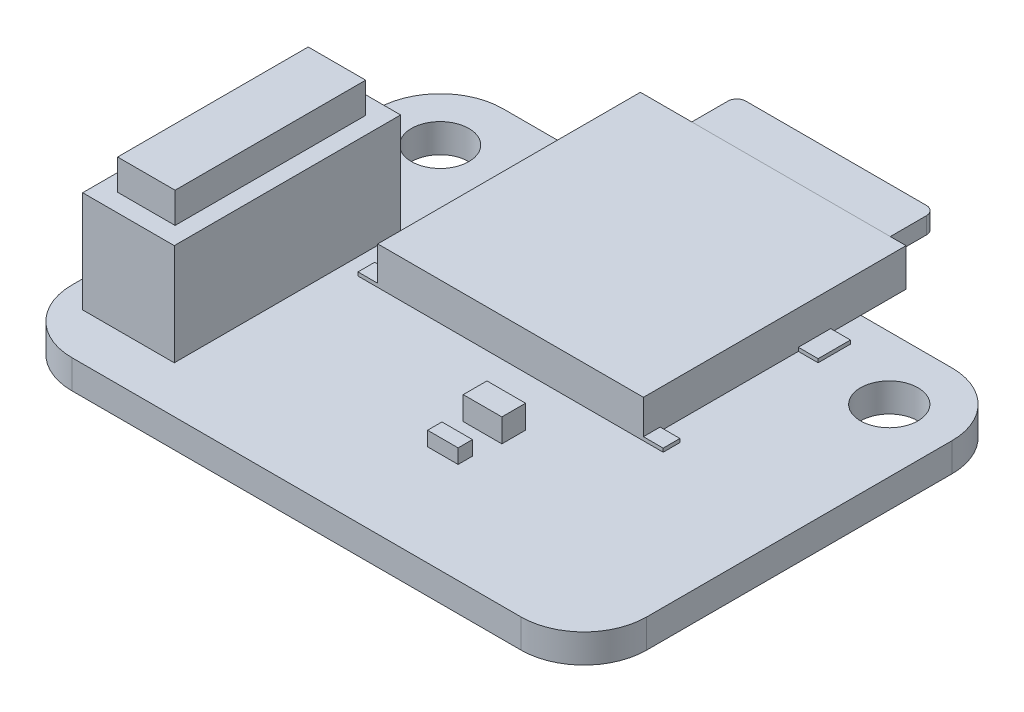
ISO-10303-21;
HEADER;
FILE_DESCRIPTION(('STEP AP214'),'2;1');
FILE_NAME('part.step','',(''),(''),'','','');
FILE_SCHEMA(('AUTOMOTIVE_DESIGN { 1 0 10303 214 1 1 1 1 }'));
ENDSEC;
DATA;
#1=APPLICATION_CONTEXT('core data for automotive mechanical design processes');
#2=APPLICATION_PROTOCOL_DEFINITION('international standard','automotive_design',2000,#1);
#3=PRODUCT_CONTEXT('',#1,'mechanical');
#4=PRODUCT('Part','Part','',(#3));
#5=PRODUCT_RELATED_PRODUCT_CATEGORY('part','',(#4));
#6=PRODUCT_DEFINITION_FORMATION('','',#4);
#7=PRODUCT_DEFINITION_CONTEXT('part definition',#1,'design');
#8=PRODUCT_DEFINITION('design','',#6,#7);
#9=PRODUCT_DEFINITION_SHAPE('','',#8);
#10=(LENGTH_UNIT() NAMED_UNIT(*) SI_UNIT(.MILLI.,.METRE.));
#11=(NAMED_UNIT(*) PLANE_ANGLE_UNIT() SI_UNIT($,.RADIAN.));
#12=(NAMED_UNIT(*) SI_UNIT($,.STERADIAN.) SOLID_ANGLE_UNIT());
#13=UNCERTAINTY_MEASURE_WITH_UNIT(LENGTH_MEASURE(1.E-05),#10,'distance_accuracy_value','');
#14=(GEOMETRIC_REPRESENTATION_CONTEXT(3) GLOBAL_UNCERTAINTY_ASSIGNED_CONTEXT((#13)) GLOBAL_UNIT_ASSIGNED_CONTEXT((#10,
#11,#12)) REPRESENTATION_CONTEXT('',''));
#15=CARTESIAN_POINT('',(0.,0.,0.));
#16=DIRECTION('',(0.,0.,1.));
#17=DIRECTION('',(1.,0.,0.));
#18=AXIS2_PLACEMENT_3D('',#15,#16,#17);
#19=CARTESIAN_POINT('',(-30.8701066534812,8.95,-2.52707340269));
#20=DIRECTION('',(0.,1.,0.));
#21=DIRECTION('',(0.,0.,1.));
#22=AXIS2_PLACEMENT_3D('',#19,#20,#21);
#23=PLANE('',#22);
#24=DIRECTION('',(0.,0.,-1.));
#25=VECTOR('',#24,1.);
#26=CARTESIAN_POINT('',(-30.8701066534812,8.95,-13.13707340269));
#27=LINE('',#26,#25);
#28=CARTESIAN_POINT('',(-30.8701066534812,8.95,-13.13707340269));
#29=VERTEX_POINT('',#28);
#30=CARTESIAN_POINT('',(-30.8701066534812,8.95,-2.52707340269));
#31=VERTEX_POINT('',#30);
#32=EDGE_CURVE('E147',#29,#31,#27,.F.);
#33=ORIENTED_EDGE('',*,*,#32,.T.);
#34=DIRECTION('',(-1.,0.,0.));
#35=VECTOR('',#34,1.);
#36=CARTESIAN_POINT('',(-30.8701066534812,8.95,-2.52707340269));
#37=LINE('',#36,#35);
#38=CARTESIAN_POINT('',(-27.6701066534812,8.95,-2.52707340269));
#39=VERTEX_POINT('',#38);
#40=EDGE_CURVE('E156',#31,#39,#37,.F.);
#41=ORIENTED_EDGE('',*,*,#40,.T.);
#42=DIRECTION('',(0.,0.,1.));
#43=VECTOR('',#42,1.);
#44=CARTESIAN_POINT('',(-27.6701066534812,8.95,-2.52707340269));
#45=LINE('',#44,#43);
#46=CARTESIAN_POINT('',(-27.6701066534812,8.95,-13.13707340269));
#47=VERTEX_POINT('',#46);
#48=EDGE_CURVE('E162',#39,#47,#45,.F.);
#49=ORIENTED_EDGE('',*,*,#48,.T.);
#50=DIRECTION('',(1.,0.,0.));
#51=VECTOR('',#50,1.);
#52=CARTESIAN_POINT('',(-29.2701066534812,8.95,-13.13707340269));
#53=LINE('',#52,#51);
#54=EDGE_CURVE('E165',#47,#29,#53,.F.);
#55=ORIENTED_EDGE('',*,*,#54,.T.);
#56=EDGE_LOOP('',(#33,#41,#49,#55));
#57=FACE_BOUND('',#56,.T.);
#58=ADVANCED_FACE('F18',(#57),#23,.T.);
#59=CARTESIAN_POINT('',(-10.8201066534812,3.65821314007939,-27.9985598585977));
#60=DIRECTION('',(0.,0.,1.));
#61=DIRECTION('',(1.,0.,0.));
#62=AXIS2_PLACEMENT_3D('',#59,#60,#61);
#63=PLANE('',#62);
#64=DIRECTION('',(1.,0.,0.));
#65=VECTOR('',#64,1.);
#66=CARTESIAN_POINT('',(-10.8201066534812,3.65821314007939,-27.9985598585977));
#67=LINE('',#66,#65);
#68=CARTESIAN_POINT('',(-21.3701066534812,3.65821314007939,-27.9985598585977));
#69=VERTEX_POINT('',#68);
#70=CARTESIAN_POINT('',(-11.3201066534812,3.65821314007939,-27.9985598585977));
#71=VERTEX_POINT('',#70);
#72=EDGE_CURVE('E122',#69,#71,#67,.T.);
#73=ORIENTED_EDGE('',*,*,#72,.T.);
#74=DIRECTION('',(0.,-1.,0.));
#75=VECTOR('',#74,1.);
#76=CARTESIAN_POINT('',(-11.3201066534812,3.65821314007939,-27.9985598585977));
#77=LINE('',#76,#75);
#78=CARTESIAN_POINT('',(-11.3201066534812,2.72821314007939,-27.9985598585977));
#79=VERTEX_POINT('',#78);
#80=EDGE_CURVE('E117',#79,#71,#77,.F.);
#81=ORIENTED_EDGE('',*,*,#80,.F.);
#82=DIRECTION('',(1.,0.,0.));
#83=VECTOR('',#82,1.);
#84=CARTESIAN_POINT('',(-21.8701066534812,2.72821314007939,-27.9985598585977));
#85=LINE('',#84,#83);
#86=CARTESIAN_POINT('',(-21.3701066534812,2.72821314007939,-27.9985598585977));
#87=VERTEX_POINT('',#86);
#88=EDGE_CURVE('E121',#79,#87,#85,.F.);
#89=ORIENTED_EDGE('',*,*,#88,.T.);
#90=DIRECTION('',(0.,1.,0.));
#91=VECTOR('',#90,1.);
#92=CARTESIAN_POINT('',(-21.3701066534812,3.65821314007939,-27.9985598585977));
#93=LINE('',#92,#91);
#94=EDGE_CURVE('E170',#69,#87,#93,.F.);
#95=ORIENTED_EDGE('',*,*,#94,.F.);
#96=EDGE_LOOP('',(#73,#81,#89,#95));
#97=FACE_BOUND('',#96,.T.);
#98=ADVANCED_FACE('F119',(#97),#63,.F.);
#99=CARTESIAN_POINT('',(-11.3201066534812,3.65821314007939,-27.4985598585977));
#100=DIRECTION('',(0.,-1.,0.));
#101=DIRECTION('',(0.,0.,-1.));
#102=AXIS2_PLACEMENT_3D('',#99,#100,#101);
#103=CYLINDRICAL_SURFACE('',#102,0.5);
#104=CARTESIAN_POINT('',(-11.3201066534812,3.65821314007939,-27.4985598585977));
#105=DIRECTION('',(0.,-1.,0.));
#106=DIRECTION('',(0.,0.,-1.));
#107=AXIS2_PLACEMENT_3D('',#104,#105,#106);
#108=CIRCLE('',#107,0.5);
#109=CARTESIAN_POINT('',(-10.8201066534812,3.65821314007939,-27.4985598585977));
#110=VERTEX_POINT('',#109);
#111=EDGE_CURVE('E232',#71,#110,#108,.T.);
#112=ORIENTED_EDGE('',*,*,#111,.T.);
#113=DIRECTION('',(0.,1.,0.));
#114=VECTOR('',#113,1.);
#115=CARTESIAN_POINT('',(-10.8201066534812,3.03611378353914,-27.4985598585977));
#116=LINE('',#115,#114);
#117=CARTESIAN_POINT('',(-10.8201066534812,2.72821314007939,-27.4985598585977));
#118=VERTEX_POINT('',#117);
#119=EDGE_CURVE('E111',#110,#118,#116,.F.);
#120=ORIENTED_EDGE('',*,*,#119,.T.);
#121=CARTESIAN_POINT('',(-11.3201066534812,2.72821314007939,-27.4985598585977));
#122=DIRECTION('',(0.,-1.,0.));
#123=DIRECTION('',(0.,0.,-1.));
#124=AXIS2_PLACEMENT_3D('',#121,#122,#123);
#125=CIRCLE('',#124,0.5);
#126=EDGE_CURVE('E21',#118,#79,#125,.F.);
#127=ORIENTED_EDGE('',*,*,#126,.T.);
#128=ORIENTED_EDGE('',*,*,#80,.T.);
#129=EDGE_LOOP('',(#112,#120,#127,#128));
#130=FACE_BOUND('',#129,.T.);
#131=ADVANCED_FACE('F134',(#130),#103,.T.);
#132=CARTESIAN_POINT('',(-10.8201066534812,3.03611378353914,-27.9985598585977));
#133=DIRECTION('',(-1.,0.,0.));
#134=DIRECTION('',(0.,0.,1.));
#135=AXIS2_PLACEMENT_3D('',#132,#133,#134);
#136=PLANE('',#135);
#137=DIRECTION('',(0.,0.,-1.));
#138=VECTOR('',#137,1.);
#139=CARTESIAN_POINT('',(-10.8201066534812,3.65821314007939,-27.9985598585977));
#140=LINE('',#139,#138);
#141=CARTESIAN_POINT('',(-10.8201066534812,3.65821314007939,-25.4485598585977));
#142=VERTEX_POINT('',#141);
#143=EDGE_CURVE('E233',#110,#142,#140,.F.);
#144=ORIENTED_EDGE('',*,*,#143,.T.);
#145=DIRECTION('',(0.,1.,0.));
#146=VECTOR('',#145,1.);
#147=CARTESIAN_POINT('',(-10.8201066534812,3.03611378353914,-25.4485598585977));
#148=LINE('',#147,#146);
#149=CARTESIAN_POINT('',(-10.8201066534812,2.72821314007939,-25.4485598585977));
#150=VERTEX_POINT('',#149);
#151=EDGE_CURVE('E124',#150,#142,#148,.T.);
#152=ORIENTED_EDGE('',*,*,#151,.F.);
#153=DIRECTION('',(0.,0.,1.));
#154=VECTOR('',#153,1.);
#155=CARTESIAN_POINT('',(-10.8201066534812,2.72821314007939,-27.9985598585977));
#156=LINE('',#155,#154);
#157=EDGE_CURVE('E135',#150,#118,#156,.F.);
#158=ORIENTED_EDGE('',*,*,#157,.T.);
#159=ORIENTED_EDGE('',*,*,#119,.F.);
#160=EDGE_LOOP('',(#144,#152,#158,#159));
#161=FACE_BOUND('',#160,.T.);
#162=ADVANCED_FACE('F1437',(#161),#136,.F.);
#163=CARTESIAN_POINT('',(-21.8701066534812,3.65821314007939,-27.9985598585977));
#164=DIRECTION('',(1.,0.,0.));
#165=DIRECTION('',(0.,0.,-1.));
#166=AXIS2_PLACEMENT_3D('',#163,#164,#165);
#167=PLANE('',#166);
#168=DIRECTION('',(0.,0.,1.));
#169=VECTOR('',#168,1.);
#170=CARTESIAN_POINT('',(-21.8701066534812,2.72821314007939,-27.9985598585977));
#171=LINE('',#170,#169);
#172=CARTESIAN_POINT('',(-21.8701066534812,2.72821314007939,-27.4985598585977));
#173=VERTEX_POINT('',#172);
#174=CARTESIAN_POINT('',(-21.8701066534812,2.72821314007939,-25.4485598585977));
#175=VERTEX_POINT('',#174);
#176=EDGE_CURVE('E136',#173,#175,#171,.T.);
#177=ORIENTED_EDGE('',*,*,#176,.T.);
#178=DIRECTION('',(0.,1.,0.));
#179=VECTOR('',#178,1.);
#180=CARTESIAN_POINT('',(-21.8701066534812,3.65821314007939,-25.4485598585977));
#181=LINE('',#180,#179);
#182=CARTESIAN_POINT('',(-21.8701066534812,3.65821314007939,-25.4485598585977));
#183=VERTEX_POINT('',#182);
#184=EDGE_CURVE('E172',#183,#175,#181,.F.);
#185=ORIENTED_EDGE('',*,*,#184,.F.);
#186=DIRECTION('',(0.,0.,-1.));
#187=VECTOR('',#186,1.);
#188=CARTESIAN_POINT('',(-21.8701066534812,3.65821314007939,-27.9985598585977));
#189=LINE('',#188,#187);
#190=CARTESIAN_POINT('',(-21.8701066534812,3.65821314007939,-27.4985598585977));
#191=VERTEX_POINT('',#190);
#192=EDGE_CURVE('E231',#183,#191,#189,.T.);
#193=ORIENTED_EDGE('',*,*,#192,.T.);
#194=DIRECTION('',(0.,1.,0.));
#195=VECTOR('',#194,1.);
#196=CARTESIAN_POINT('',(-21.8701066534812,3.65821314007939,-27.4985598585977));
#197=LINE('',#196,#195);
#198=EDGE_CURVE('E168',#173,#191,#197,.T.);
#199=ORIENTED_EDGE('',*,*,#198,.F.);
#200=EDGE_LOOP('',(#177,#185,#193,#199));
#201=FACE_BOUND('',#200,.T.);
#202=ADVANCED_FACE('F1428',(#201),#167,.F.);
#203=CARTESIAN_POINT('',(-21.3701066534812,3.65821314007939,-27.4985598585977));
#204=DIRECTION('',(0.,1.,0.));
#205=DIRECTION('',(0.,0.,1.));
#206=AXIS2_PLACEMENT_3D('',#203,#204,#205);
#207=CYLINDRICAL_SURFACE('',#206,0.5);
#208=CARTESIAN_POINT('',(-21.3701066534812,2.72821314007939,-27.4985598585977));
#209=DIRECTION('',(0.,1.,0.));
#210=DIRECTION('',(0.,0.,1.));
#211=AXIS2_PLACEMENT_3D('',#208,#209,#210);
#212=CIRCLE('',#211,0.5);
#213=EDGE_CURVE('E132',#87,#173,#212,.T.);
#214=ORIENTED_EDGE('',*,*,#213,.T.);
#215=ORIENTED_EDGE('',*,*,#198,.T.);
#216=CARTESIAN_POINT('',(-21.3701066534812,3.65821314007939,-27.4985598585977));
#217=DIRECTION('',(0.,1.,0.));
#218=DIRECTION('',(0.,0.,1.));
#219=AXIS2_PLACEMENT_3D('',#216,#217,#218);
#220=CIRCLE('',#219,0.5);
#221=EDGE_CURVE('E227',#191,#69,#220,.F.);
#222=ORIENTED_EDGE('',*,*,#221,.T.);
#223=ORIENTED_EDGE('',*,*,#94,.T.);
#224=EDGE_LOOP('',(#214,#215,#222,#223));
#225=FACE_BOUND('',#224,.T.);
#226=ADVANCED_FACE('F1418',(#225),#207,.T.);
#227=CARTESIAN_POINT('',(-29.2701066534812,8.95,-13.13707340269));
#228=DIRECTION('',(0.,0.,1.));
#229=DIRECTION('',(1.,0.,0.));
#230=AXIS2_PLACEMENT_3D('',#227,#228,#229);
#231=PLANE('',#230);
#232=ORIENTED_EDGE('',*,*,#54,.F.);
#233=DIRECTION('',(0.,1.,0.));
#234=VECTOR('',#233,1.);
#235=CARTESIAN_POINT('',(-27.6701066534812,8.95,-13.13707340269));
#236=LINE('',#235,#234);
#237=CARTESIAN_POINT('',(-27.6701066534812,7.25,-13.13707340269));
#238=VERTEX_POINT('',#237);
#239=EDGE_CURVE('E159',#47,#238,#236,.F.);
#240=ORIENTED_EDGE('',*,*,#239,.T.);
#241=DIRECTION('',(1.,0.,0.));
#242=VECTOR('',#241,1.);
#243=CARTESIAN_POINT('',(-31.8201066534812,7.25,-13.13707340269));
#244=LINE('',#243,#242);
#245=CARTESIAN_POINT('',(-30.8701066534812,7.25,-13.13707340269));
#246=VERTEX_POINT('',#245);
#247=EDGE_CURVE('E315',#246,#238,#244,.T.);
#248=ORIENTED_EDGE('',*,*,#247,.F.);
#249=DIRECTION('',(0.,1.,0.));
#250=VECTOR('',#249,1.);
#251=CARTESIAN_POINT('',(-30.8701066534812,8.95,-13.13707340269));
#252=LINE('',#251,#250);
#253=EDGE_CURVE('E150',#246,#29,#252,.T.);
#254=ORIENTED_EDGE('',*,*,#253,.T.);
#255=EDGE_LOOP('',(#232,#240,#248,#254));
#256=FACE_BOUND('',#255,.T.);
#257=ADVANCED_FACE('F1408',(#256),#231,.F.);
#258=CARTESIAN_POINT('',(-27.6701066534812,8.95,-2.52707340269));
#259=DIRECTION('',(-1.,0.,0.));
#260=DIRECTION('',(0.,0.,1.));
#261=AXIS2_PLACEMENT_3D('',#258,#259,#260);
#262=PLANE('',#261);
#263=ORIENTED_EDGE('',*,*,#48,.F.);
#264=DIRECTION('',(0.,1.,0.));
#265=VECTOR('',#264,1.);
#266=CARTESIAN_POINT('',(-27.6701066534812,8.95,-2.52707340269));
#267=LINE('',#266,#265);
#268=CARTESIAN_POINT('',(-27.6701066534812,7.25,-2.52707340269));
#269=VERTEX_POINT('',#268);
#270=EDGE_CURVE('E153',#39,#269,#267,.F.);
#271=ORIENTED_EDGE('',*,*,#270,.T.);
#272=DIRECTION('',(0.,0.,1.));
#273=VECTOR('',#272,1.);
#274=CARTESIAN_POINT('',(-27.6701066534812,7.25,-14.13207340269));
#275=LINE('',#274,#273);
#276=EDGE_CURVE('E318',#238,#269,#275,.T.);
#277=ORIENTED_EDGE('',*,*,#276,.F.);
#278=ORIENTED_EDGE('',*,*,#239,.F.);
#279=EDGE_LOOP('',(#263,#271,#277,#278));
#280=FACE_BOUND('',#279,.T.);
#281=ADVANCED_FACE('F1398',(#280),#262,.F.);
#282=CARTESIAN_POINT('',(-30.8701066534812,8.95,-2.52707340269));
#283=DIRECTION('',(0.,0.,-1.));
#284=DIRECTION('',(-1.,0.,0.));
#285=AXIS2_PLACEMENT_3D('',#282,#283,#284);
#286=PLANE('',#285);
#287=ORIENTED_EDGE('',*,*,#40,.F.);
#288=DIRECTION('',(0.,1.,0.));
#289=VECTOR('',#288,1.);
#290=CARTESIAN_POINT('',(-30.8701066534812,8.95,-2.52707340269));
#291=LINE('',#290,#289);
#292=CARTESIAN_POINT('',(-30.8701066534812,7.25,-2.52707340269));
#293=VERTEX_POINT('',#292);
#294=EDGE_CURVE('E141',#31,#293,#291,.F.);
#295=ORIENTED_EDGE('',*,*,#294,.T.);
#296=DIRECTION('',(1.,0.,0.));
#297=VECTOR('',#296,1.);
#298=CARTESIAN_POINT('',(-31.8201066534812,7.25,-2.52707340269));
#299=LINE('',#298,#297);
#300=EDGE_CURVE('E321',#269,#293,#299,.F.);
#301=ORIENTED_EDGE('',*,*,#300,.F.);
#302=ORIENTED_EDGE('',*,*,#270,.F.);
#303=EDGE_LOOP('',(#287,#295,#301,#302));
#304=FACE_BOUND('',#303,.T.);
#305=ADVANCED_FACE('F1388',(#304),#286,.F.);
#306=CARTESIAN_POINT('',(-30.8701066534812,8.95,-13.13707340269));
#307=DIRECTION('',(1.,0.,0.));
#308=DIRECTION('',(0.,0.,-1.));
#309=AXIS2_PLACEMENT_3D('',#306,#307,#308);
#310=PLANE('',#309);
#311=ORIENTED_EDGE('',*,*,#32,.F.);
#312=ORIENTED_EDGE('',*,*,#253,.F.);
#313=DIRECTION('',(0.,0.,1.));
#314=VECTOR('',#313,1.);
#315=CARTESIAN_POINT('',(-30.8701066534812,7.25,-14.13207340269));
#316=LINE('',#315,#314);
#317=EDGE_CURVE('E184',#293,#246,#316,.F.);
#318=ORIENTED_EDGE('',*,*,#317,.F.);
#319=ORIENTED_EDGE('',*,*,#294,.F.);
#320=EDGE_LOOP('',(#311,#312,#318,#319));
#321=FACE_BOUND('',#320,.T.);
#322=ADVANCED_FACE('F1379',(#321),#310,.F.);
#323=CARTESIAN_POINT('',(-21.8701066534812,2.72821314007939,-27.9985598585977));
#324=DIRECTION('',(0.,1.,0.));
#325=DIRECTION('',(0.,0.,1.));
#326=AXIS2_PLACEMENT_3D('',#323,#324,#325);
#327=PLANE('',#326);
#328=ORIENTED_EDGE('',*,*,#88,.F.);
#329=ORIENTED_EDGE('',*,*,#126,.F.);
#330=ORIENTED_EDGE('',*,*,#157,.F.);
#331=DIRECTION('',(1.,0.,0.));
#332=VECTOR('',#331,1.);
#333=CARTESIAN_POINT('',(-24.6901066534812,2.72821314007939,-25.4485598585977));
#334=LINE('',#333,#332);
#335=EDGE_CURVE('E179',#150,#175,#334,.F.);
#336=ORIENTED_EDGE('',*,*,#335,.T.);
#337=ORIENTED_EDGE('',*,*,#176,.F.);
#338=ORIENTED_EDGE('',*,*,#213,.F.);
#339=EDGE_LOOP('',(#328,#329,#330,#336,#337,#338));
#340=FACE_BOUND('',#339,.T.);
#341=ADVANCED_FACE('F128',(#340),#327,.F.);
#342=CARTESIAN_POINT('',(-10.8201066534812,3.65821314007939,-27.9985598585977));
#343=DIRECTION('',(0.,-1.,0.));
#344=DIRECTION('',(0.,0.,-1.));
#345=AXIS2_PLACEMENT_3D('',#342,#343,#344);
#346=PLANE('',#345);
#347=ORIENTED_EDGE('',*,*,#192,.F.);
#348=DIRECTION('',(1.,0.,0.));
#349=VECTOR('',#348,1.);
#350=CARTESIAN_POINT('',(-24.6901066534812,3.65821314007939,-25.4485598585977));
#351=LINE('',#350,#349);
#352=EDGE_CURVE('E175',#183,#142,#351,.T.);
#353=ORIENTED_EDGE('',*,*,#352,.T.);
#354=ORIENTED_EDGE('',*,*,#143,.F.);
#355=ORIENTED_EDGE('',*,*,#111,.F.);
#356=ORIENTED_EDGE('',*,*,#72,.F.);
#357=ORIENTED_EDGE('',*,*,#221,.F.);
#358=EDGE_LOOP('',(#347,#353,#354,#355,#356,#357));
#359=FACE_BOUND('',#358,.T.);
#360=ADVANCED_FACE('F1361',(#359),#346,.F.);
#361=CARTESIAN_POINT('',(-24.6901066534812,1.8,-10.8285598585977));
#362=DIRECTION('',(0.,-1.,0.));
#363=DIRECTION('',(0.,0.,-1.));
#364=AXIS2_PLACEMENT_3D('',#361,#362,#363);
#365=PLANE('',#364);
#366=DIRECTION('',(0.,0.,-1.));
#367=VECTOR('',#366,1.);
#368=CARTESIAN_POINT('',(-25.7901066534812,1.8,-10.8285598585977));
#369=LINE('',#368,#367);
#370=CARTESIAN_POINT('',(-25.7901066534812,1.8,-11.7585598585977));
#371=VERTEX_POINT('',#370);
#372=CARTESIAN_POINT('',(-25.7901066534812,1.8,-10.8285598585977));
#373=VERTEX_POINT('',#372);
#374=EDGE_CURVE('E257',#371,#373,#369,.F.);
#375=ORIENTED_EDGE('',*,*,#374,.T.);
#376=DIRECTION('',(-1.,0.,0.));
#377=VECTOR('',#376,1.);
#378=CARTESIAN_POINT('',(-9.90010665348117,1.8,-10.8285598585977));
#379=LINE('',#378,#377);
#380=CARTESIAN_POINT('',(-24.6901066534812,1.8,-10.8285598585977));
#381=VERTEX_POINT('',#380);
#382=EDGE_CURVE('E253',#373,#381,#379,.F.);
#383=ORIENTED_EDGE('',*,*,#382,.T.);
#384=DIRECTION('',(0.,0.,-1.));
#385=VECTOR('',#384,1.);
#386=CARTESIAN_POINT('',(-24.6901066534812,1.8,-17.2425048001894));
#387=LINE('',#386,#385);
#388=CARTESIAN_POINT('',(-24.6901066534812,1.8,-11.7585598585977));
#389=VERTEX_POINT('',#388);
#390=EDGE_CURVE('E248',#381,#389,#387,.T.);
#391=ORIENTED_EDGE('',*,*,#390,.T.);
#392=DIRECTION('',(1.,0.,0.));
#393=VECTOR('',#392,1.);
#394=CARTESIAN_POINT('',(-25.7901066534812,1.8,-11.7585598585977));
#395=LINE('',#394,#393);
#396=EDGE_CURVE('E346',#389,#371,#395,.F.);
#397=ORIENTED_EDGE('',*,*,#396,.T.);
#398=EDGE_LOOP('',(#375,#383,#391,#397));
#399=FACE_BOUND('',#398,.T.);
#400=ADVANCED_FACE('F713',(#399),#365,.F.);
#401=CARTESIAN_POINT('',(-24.6901066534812,1.8,-19.45207340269));
#402=DIRECTION('',(0.,-1.,0.));
#403=DIRECTION('',(0.,0.,-1.));
#404=AXIS2_PLACEMENT_3D('',#401,#402,#403);
#405=PLANE('',#404);
#406=DIRECTION('',(1.,0.,0.));
#407=VECTOR('',#406,1.);
#408=CARTESIAN_POINT('',(-24.6901066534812,1.8,-21.25207340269));
#409=LINE('',#408,#407);
#410=CARTESIAN_POINT('',(-25.7901066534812,1.8,-21.25207340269));
#411=VERTEX_POINT('',#410);
#412=CARTESIAN_POINT('',(-24.6901066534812,1.8,-21.25207340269));
#413=VERTEX_POINT('',#412);
#414=EDGE_CURVE('E230',#411,#413,#409,.T.);
#415=ORIENTED_EDGE('',*,*,#414,.F.);
#416=DIRECTION('',(0.,0.,-1.));
#417=VECTOR('',#416,1.);
#418=CARTESIAN_POINT('',(-25.7901066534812,1.8,-21.25207340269));
#419=LINE('',#418,#417);
#420=CARTESIAN_POINT('',(-25.7901066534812,1.8,-19.45207340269));
#421=VERTEX_POINT('',#420);
#422=EDGE_CURVE('E365',#411,#421,#419,.F.);
#423=ORIENTED_EDGE('',*,*,#422,.T.);
#424=DIRECTION('',(-1.,0.,0.));
#425=VECTOR('',#424,1.);
#426=CARTESIAN_POINT('',(-25.7901066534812,1.8,-19.45207340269));
#427=LINE('',#426,#425);
#428=CARTESIAN_POINT('',(-24.6901066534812,1.8,-19.45207340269));
#429=VERTEX_POINT('',#428);
#430=EDGE_CURVE('E359',#421,#429,#427,.F.);
#431=ORIENTED_EDGE('',*,*,#430,.T.);
#432=DIRECTION('',(0.,0.,-1.));
#433=VECTOR('',#432,1.);
#434=CARTESIAN_POINT('',(-24.6901066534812,1.8,-17.2425048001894));
#435=LINE('',#434,#433);
#436=EDGE_CURVE('E338',#429,#413,#435,.T.);
#437=ORIENTED_EDGE('',*,*,#436,.T.);
#438=EDGE_LOOP('',(#415,#423,#431,#437));
#439=FACE_BOUND('',#438,.T.);
#440=ADVANCED_FACE('F1344',(#439),#405,.F.);
#441=CARTESIAN_POINT('',(-24.6901066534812,3.7,-25.4485598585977));
#442=DIRECTION('',(0.,-1.,0.));
#443=DIRECTION('',(0.,0.,-1.));
#444=AXIS2_PLACEMENT_3D('',#441,#442,#443);
#445=PLANE('',#444);
#446=DIRECTION('',(0.,0.,1.));
#447=VECTOR('',#446,1.);
#448=CARTESIAN_POINT('',(-9.90010665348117,3.7,-25.4485598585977));
#449=LINE('',#448,#447);
#450=CARTESIAN_POINT('',(-9.90010665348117,3.7,-10.8285598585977));
#451=VERTEX_POINT('',#450);
#452=CARTESIAN_POINT('',(-9.90010665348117,3.7,-25.4485598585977));
#453=VERTEX_POINT('',#452);
#454=EDGE_CURVE('E301',#451,#453,#449,.F.);
#455=ORIENTED_EDGE('',*,*,#454,.T.);
#456=DIRECTION('',(1.,0.,0.));
#457=VECTOR('',#456,1.);
#458=CARTESIAN_POINT('',(-24.6901066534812,3.7,-25.4485598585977));
#459=LINE('',#458,#457);
#460=CARTESIAN_POINT('',(-24.6901066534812,3.7,-25.4485598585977));
#461=VERTEX_POINT('',#460);
#462=EDGE_CURVE('E178',#453,#461,#459,.F.);
#463=ORIENTED_EDGE('',*,*,#462,.T.);
#464=DIRECTION('',(0.,0.,-1.));
#465=VECTOR('',#464,1.);
#466=CARTESIAN_POINT('',(-24.6901066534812,3.7,-17.2425048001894));
#467=LINE('',#466,#465);
#468=CARTESIAN_POINT('',(-24.6901066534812,3.7,-10.8285598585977));
#469=VERTEX_POINT('',#468);
#470=EDGE_CURVE('E249',#461,#469,#467,.F.);
#471=ORIENTED_EDGE('',*,*,#470,.T.);
#472=DIRECTION('',(-1.,0.,0.));
#473=VECTOR('',#472,1.);
#474=CARTESIAN_POINT('',(-9.90010665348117,3.7,-10.8285598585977));
#475=LINE('',#474,#473);
#476=EDGE_CURVE('E296',#469,#451,#475,.F.);
#477=ORIENTED_EDGE('',*,*,#476,.T.);
#478=EDGE_LOOP('',(#455,#463,#471,#477));
#479=FACE_BOUND('',#478,.T.);
#480=ADVANCED_FACE('F809',(#479),#445,.F.);
#481=CARTESIAN_POINT('',(-9.90010665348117,1.8,-21.25207340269));
#482=DIRECTION('',(0.,-1.,0.));
#483=DIRECTION('',(0.,0.,-1.));
#484=AXIS2_PLACEMENT_3D('',#481,#482,#483);
#485=PLANE('',#484);
#486=DIRECTION('',(-1.,0.,0.));
#487=VECTOR('',#486,1.);
#488=CARTESIAN_POINT('',(-9.90010665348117,1.8,-19.45207340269));
#489=LINE('',#488,#487);
#490=CARTESIAN_POINT('',(-9.90010665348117,1.8,-19.45207340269));
#491=VERTEX_POINT('',#490);
#492=CARTESIAN_POINT('',(-8.80010665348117,1.8,-19.45207340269));
#493=VERTEX_POINT('',#492);
#494=EDGE_CURVE('E282',#491,#493,#489,.F.);
#495=ORIENTED_EDGE('',*,*,#494,.T.);
#496=DIRECTION('',(0.,0.,1.));
#497=VECTOR('',#496,1.);
#498=CARTESIAN_POINT('',(-8.80010665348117,1.8,-19.45207340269));
#499=LINE('',#498,#497);
#500=CARTESIAN_POINT('',(-8.80010665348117,1.8,-21.25207340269));
#501=VERTEX_POINT('',#500);
#502=EDGE_CURVE('E275',#493,#501,#499,.F.);
#503=ORIENTED_EDGE('',*,*,#502,.T.);
#504=DIRECTION('',(1.,0.,0.));
#505=VECTOR('',#504,1.);
#506=CARTESIAN_POINT('',(-9.13101243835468,1.8,-21.25207340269));
#507=LINE('',#506,#505);
#508=CARTESIAN_POINT('',(-9.90010665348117,1.8,-21.25207340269));
#509=VERTEX_POINT('',#508);
#510=EDGE_CURVE('E279',#501,#509,#507,.F.);
#511=ORIENTED_EDGE('',*,*,#510,.T.);
#512=DIRECTION('',(0.,0.,1.));
#513=VECTOR('',#512,1.);
#514=CARTESIAN_POINT('',(-9.90010665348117,1.8,-25.4485598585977));
#515=LINE('',#514,#513);
#516=EDGE_CURVE('E307',#509,#491,#515,.T.);
#517=ORIENTED_EDGE('',*,*,#516,.T.);
#518=EDGE_LOOP('',(#495,#503,#511,#517));
#519=FACE_BOUND('',#518,.T.);
#520=ADVANCED_FACE('F781',(#519),#485,.F.);
#521=CARTESIAN_POINT('',(-9.90010665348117,1.8,-10.8285598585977));
#522=DIRECTION('',(0.,1.,0.));
#523=DIRECTION('',(0.,0.,1.));
#524=AXIS2_PLACEMENT_3D('',#521,#522,#523);
#525=PLANE('',#524);
#526=DIRECTION('',(0.,0.,1.));
#527=VECTOR('',#526,1.);
#528=CARTESIAN_POINT('',(-9.90010665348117,1.8,-25.4485598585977));
#529=LINE('',#528,#527);
#530=CARTESIAN_POINT('',(-9.90010665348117,1.8,-11.7585598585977));
#531=VERTEX_POINT('',#530);
#532=CARTESIAN_POINT('',(-9.90010665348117,1.8,-10.8285598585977));
#533=VERTEX_POINT('',#532);
#534=EDGE_CURVE('E289',#531,#533,#529,.T.);
#535=ORIENTED_EDGE('',*,*,#534,.T.);
#536=DIRECTION('',(-1.,0.,0.));
#537=VECTOR('',#536,1.);
#538=CARTESIAN_POINT('',(-9.90010665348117,1.8,-10.8285598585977));
#539=LINE('',#538,#537);
#540=CARTESIAN_POINT('',(-8.80010665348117,1.8,-10.8285598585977));
#541=VERTEX_POINT('',#540);
#542=EDGE_CURVE('E258',#533,#541,#539,.F.);
#543=ORIENTED_EDGE('',*,*,#542,.T.);
#544=DIRECTION('',(0.,0.,1.));
#545=VECTOR('',#544,1.);
#546=CARTESIAN_POINT('',(-8.80010665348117,1.8,-10.8285598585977));
#547=LINE('',#546,#545);
#548=CARTESIAN_POINT('',(-8.80010665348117,1.8,-11.7585598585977));
#549=VERTEX_POINT('',#548);
#550=EDGE_CURVE('E250',#541,#549,#547,.F.);
#551=ORIENTED_EDGE('',*,*,#550,.T.);
#552=DIRECTION('',(1.,0.,0.));
#553=VECTOR('',#552,1.);
#554=CARTESIAN_POINT('',(-8.80010665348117,1.8,-11.7585598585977));
#555=LINE('',#554,#553);
#556=EDGE_CURVE('E243',#549,#531,#555,.F.);
#557=ORIENTED_EDGE('',*,*,#556,.T.);
#558=EDGE_LOOP('',(#535,#543,#551,#557));
#559=FACE_BOUND('',#558,.T.);
#560=ADVANCED_FACE('F813',(#559),#525,.T.);
#561=CARTESIAN_POINT('',(-13.6951066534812,2.9,-6.74207340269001));
#562=DIRECTION('',(0.,1.,0.));
#563=DIRECTION('',(0.,0.,1.));
#564=AXIS2_PLACEMENT_3D('',#561,#562,#563);
#565=PLANE('',#564);
#566=DIRECTION('',(-1.,0.,0.));
#567=VECTOR('',#566,1.);
#568=CARTESIAN_POINT('',(-14.7701066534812,2.9,-6.74207340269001));
#569=LINE('',#568,#567);
#570=CARTESIAN_POINT('',(-15.8451066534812,2.9,-6.74207340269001));
#571=VERTEX_POINT('',#570);
#572=CARTESIAN_POINT('',(-13.6951066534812,2.9,-6.74207340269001));
#573=VERTEX_POINT('',#572);
#574=EDGE_CURVE('E288',#571,#573,#569,.F.);
#575=ORIENTED_EDGE('',*,*,#574,.T.);
#576=DIRECTION('',(0.,0.,1.));
#577=VECTOR('',#576,1.);
#578=CARTESIAN_POINT('',(-13.6951066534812,2.9,-6.74207340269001));
#579=LINE('',#578,#577);
#580=CARTESIAN_POINT('',(-13.6951066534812,2.9,-8.06207340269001));
#581=VERTEX_POINT('',#580);
#582=EDGE_CURVE('E274',#573,#581,#579,.F.);
#583=ORIENTED_EDGE('',*,*,#582,.T.);
#584=DIRECTION('',(1.,0.,0.));
#585=VECTOR('',#584,1.);
#586=CARTESIAN_POINT('',(-15.8451066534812,2.9,-8.06207340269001));
#587=LINE('',#586,#585);
#588=CARTESIAN_POINT('',(-15.8451066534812,2.9,-8.06207340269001));
#589=VERTEX_POINT('',#588);
#590=EDGE_CURVE('E392',#581,#589,#587,.F.);
#591=ORIENTED_EDGE('',*,*,#590,.T.);
#592=DIRECTION('',(0.,0.,-1.));
#593=VECTOR('',#592,1.);
#594=CARTESIAN_POINT('',(-15.8451066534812,2.9,-6.74207340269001));
#595=LINE('',#594,#593);
#596=EDGE_CURVE('E386',#589,#571,#595,.F.);
#597=ORIENTED_EDGE('',*,*,#596,.T.);
#598=EDGE_LOOP('',(#575,#583,#591,#597));
#599=FACE_BOUND('',#598,.T.);
#600=ADVANCED_FACE('F878',(#599),#565,.T.);
#601=CARTESIAN_POINT('',(-31.8201066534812,7.25,-14.13207340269));
#602=DIRECTION('',(0.,1.,0.));
#603=DIRECTION('',(0.,0.,1.));
#604=AXIS2_PLACEMENT_3D('',#601,#602,#603);
#605=PLANE('',#604);
#606=DIRECTION('',(1.,0.,0.));
#607=VECTOR('',#606,1.);
#608=CARTESIAN_POINT('',(-28.7936182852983,7.25,-14.13207340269));
#609=LINE('',#608,#607);
#610=CARTESIAN_POINT('',(-26.7201066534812,7.25,-14.13207340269));
#611=VERTEX_POINT('',#610);
#612=CARTESIAN_POINT('',(-31.8201066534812,7.25,-14.13207340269));
#613=VERTEX_POINT('',#612);
#614=EDGE_CURVE('E422',#611,#613,#609,.F.);
#615=ORIENTED_EDGE('',*,*,#614,.T.);
#616=DIRECTION('',(0.,0.,-1.));
#617=VECTOR('',#616,1.);
#618=CARTESIAN_POINT('',(-31.8201066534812,7.25,-14.13207340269));
#619=LINE('',#618,#617);
#620=CARTESIAN_POINT('',(-31.8201066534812,7.25,-1.53207340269));
#621=VERTEX_POINT('',#620);
#622=EDGE_CURVE('E413',#613,#621,#619,.F.);
#623=ORIENTED_EDGE('',*,*,#622,.T.);
#624=DIRECTION('',(-1.,0.,0.));
#625=VECTOR('',#624,1.);
#626=CARTESIAN_POINT('',(-31.8201066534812,7.25,-1.53207340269));
#627=LINE('',#626,#625);
#628=CARTESIAN_POINT('',(-26.7201066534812,7.25,-1.53207340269));
#629=VERTEX_POINT('',#628);
#630=EDGE_CURVE('E407',#621,#629,#627,.F.);
#631=ORIENTED_EDGE('',*,*,#630,.T.);
#632=DIRECTION('',(0.,0.,1.));
#633=VECTOR('',#632,1.);
#634=CARTESIAN_POINT('',(-26.7201066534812,7.25,-1.53207340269));
#635=LINE('',#634,#633);
#636=EDGE_CURVE('E404',#629,#611,#635,.F.);
#637=ORIENTED_EDGE('',*,*,#636,.T.);
#638=EDGE_LOOP('',(#615,#623,#631,#637));
#639=FACE_BOUND('',#638,.T.);
#640=ORIENTED_EDGE('',*,*,#300,.T.);
#641=ORIENTED_EDGE('',*,*,#317,.T.);
#642=ORIENTED_EDGE('',*,*,#247,.T.);
#643=ORIENTED_EDGE('',*,*,#276,.T.);
#644=EDGE_LOOP('',(#640,#641,#642,#643));
#645=FACE_BOUND('',#644,.T.);
#646=ADVANCED_FACE('F870',(#639,#645),#605,.T.);
#647=CARTESIAN_POINT('',(-13.9201066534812,2.4,-4.53207340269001));
#648=DIRECTION('',(0.,1.,0.));
#649=DIRECTION('',(0.,0.,1.));
#650=AXIS2_PLACEMENT_3D('',#647,#648,#649);
#651=PLANE('',#650);
#652=DIRECTION('',(-1.,0.,0.));
#653=VECTOR('',#652,1.);
#654=CARTESIAN_POINT('',(-15.6201066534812,2.4,-4.53207340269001));
#655=LINE('',#654,#653);
#656=CARTESIAN_POINT('',(-15.6201066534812,2.4,-4.53207340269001));
#657=VERTEX_POINT('',#656);
#658=CARTESIAN_POINT('',(-13.9201066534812,2.4,-4.53207340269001));
#659=VERTEX_POINT('',#658);
#660=EDGE_CURVE('E446',#657,#659,#655,.F.);
#661=ORIENTED_EDGE('',*,*,#660,.T.);
#662=DIRECTION('',(0.,0.,1.));
#663=VECTOR('',#662,1.);
#664=CARTESIAN_POINT('',(-13.9201066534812,2.4,-4.53207340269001));
#665=LINE('',#664,#663);
#666=CARTESIAN_POINT('',(-13.9201066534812,2.4,-5.33207340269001));
#667=VERTEX_POINT('',#666);
#668=EDGE_CURVE('E437',#659,#667,#665,.F.);
#669=ORIENTED_EDGE('',*,*,#668,.T.);
#670=DIRECTION('',(1.,0.,0.));
#671=VECTOR('',#670,1.);
#672=CARTESIAN_POINT('',(-13.9201066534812,2.4,-5.33207340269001));
#673=LINE('',#672,#671);
#674=CARTESIAN_POINT('',(-15.6201066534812,2.4,-5.33207340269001));
#675=VERTEX_POINT('',#674);
#676=EDGE_CURVE('E431',#667,#675,#673,.F.);
#677=ORIENTED_EDGE('',*,*,#676,.T.);
#678=DIRECTION('',(0.,0.,-1.));
#679=VECTOR('',#678,1.);
#680=CARTESIAN_POINT('',(-15.6201066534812,2.4,-5.33207340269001));
#681=LINE('',#680,#679);
#682=EDGE_CURVE('E428',#675,#657,#681,.F.);
#683=ORIENTED_EDGE('',*,*,#682,.T.);
#684=EDGE_LOOP('',(#661,#669,#677,#683));
#685=FACE_BOUND('',#684,.T.);
#686=ADVANCED_FACE('F868',(#685),#651,.T.);
#687=CARTESIAN_POINT('',(-24.6901066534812,3.7,-25.4485598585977));
#688=DIRECTION('',(0.,0.,1.));
#689=DIRECTION('',(1.,0.,0.));
#690=AXIS2_PLACEMENT_3D('',#687,#688,#689);
#691=PLANE('',#690);
#692=ORIENTED_EDGE('',*,*,#462,.F.);
#693=DIRECTION('',(0.,1.,0.));
#694=VECTOR('',#693,1.);
#695=CARTESIAN_POINT('',(-9.90010665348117,3.7,-25.4485598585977));
#696=LINE('',#695,#694);
#697=CARTESIAN_POINT('',(-9.90010665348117,1.6,-25.4485598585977));
#698=VERTEX_POINT('',#697);
#699=EDGE_CURVE('E304',#453,#698,#696,.F.);
#700=ORIENTED_EDGE('',*,*,#699,.T.);
#701=DIRECTION('',(1.,0.,0.));
#702=VECTOR('',#701,1.);
#703=CARTESIAN_POINT('',(-24.6901066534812,1.6,-25.4485598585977));
#704=LINE('',#703,#702);
#705=CARTESIAN_POINT('',(-24.6901066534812,1.6,-25.4485598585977));
#706=VERTEX_POINT('',#705);
#707=EDGE_CURVE('E328',#706,#698,#704,.T.);
#708=ORIENTED_EDGE('',*,*,#707,.F.);
#709=DIRECTION('',(0.,1.,0.));
#710=VECTOR('',#709,1.);
#711=CARTESIAN_POINT('',(-24.6901066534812,3.7,-25.4485598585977));
#712=LINE('',#711,#710);
#713=EDGE_CURVE('E271',#706,#461,#712,.T.);
#714=ORIENTED_EDGE('',*,*,#713,.T.);
#715=EDGE_LOOP('',(#692,#700,#708,#714));
#716=FACE_BOUND('',#715,.T.);
#717=ORIENTED_EDGE('',*,*,#352,.F.);
#718=ORIENTED_EDGE('',*,*,#184,.T.);
#719=ORIENTED_EDGE('',*,*,#335,.F.);
#720=ORIENTED_EDGE('',*,*,#151,.T.);
#721=EDGE_LOOP('',(#717,#718,#719,#720));
#722=FACE_BOUND('',#721,.T.);
#723=ADVANCED_FACE('F803',(#716,#722),#691,.F.);
#724=CARTESIAN_POINT('',(-8.80010665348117,1.8,-10.8285598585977));
#725=DIRECTION('',(-1.,0.,0.));
#726=DIRECTION('',(0.,0.,1.));
#727=AXIS2_PLACEMENT_3D('',#724,#725,#726);
#728=PLANE('',#727);
#729=ORIENTED_EDGE('',*,*,#550,.F.);
#730=DIRECTION('',(0.,1.,0.));
#731=VECTOR('',#730,1.);
#732=CARTESIAN_POINT('',(-8.80010665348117,3.7,-10.8285598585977));
#733=LINE('',#732,#731);
#734=CARTESIAN_POINT('',(-8.80010665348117,1.6,-10.8285598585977));
#735=VERTEX_POINT('',#734);
#736=EDGE_CURVE('E254',#541,#735,#733,.F.);
#737=ORIENTED_EDGE('',*,*,#736,.T.);
#738=DIRECTION('',(0.,0.,1.));
#739=VECTOR('',#738,1.);
#740=CARTESIAN_POINT('',(-8.80010665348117,1.6,-19.43207340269));
#741=LINE('',#740,#739);
#742=CARTESIAN_POINT('',(-8.80010665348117,1.6,-11.7585598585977));
#743=VERTEX_POINT('',#742);
#744=EDGE_CURVE('E462',#743,#735,#741,.T.);
#745=ORIENTED_EDGE('',*,*,#744,.F.);
#746=DIRECTION('',(0.,1.,0.));
#747=VECTOR('',#746,1.);
#748=CARTESIAN_POINT('',(-8.80010665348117,1.8,-11.7585598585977));
#749=LINE('',#748,#747);
#750=EDGE_CURVE('E240',#743,#549,#749,.T.);
#751=ORIENTED_EDGE('',*,*,#750,.T.);
#752=EDGE_LOOP('',(#729,#737,#745,#751));
#753=FACE_BOUND('',#752,.T.);
#754=ADVANCED_FACE('F820',(#753),#728,.F.);
#755=CARTESIAN_POINT('',(-9.90010665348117,3.7,-10.8285598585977));
#756=DIRECTION('',(0.,0.,-1.));
#757=DIRECTION('',(-1.,0.,0.));
#758=AXIS2_PLACEMENT_3D('',#755,#756,#757);
#759=PLANE('',#758);
#760=ORIENTED_EDGE('',*,*,#542,.F.);
#761=DIRECTION('',(0.,1.,0.));
#762=VECTOR('',#761,1.);
#763=CARTESIAN_POINT('',(-9.90010665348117,3.7,-10.8285598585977));
#764=LINE('',#763,#762);
#765=EDGE_CURVE('E292',#533,#451,#764,.T.);
#766=ORIENTED_EDGE('',*,*,#765,.T.);
#767=ORIENTED_EDGE('',*,*,#476,.F.);
#768=DIRECTION('',(0.,1.,0.));
#769=VECTOR('',#768,1.);
#770=CARTESIAN_POINT('',(-24.6901066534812,3.7,-10.8285598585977));
#771=LINE('',#770,#769);
#772=EDGE_CURVE('E245',#469,#381,#771,.F.);
#773=ORIENTED_EDGE('',*,*,#772,.T.);
#774=ORIENTED_EDGE('',*,*,#382,.F.);
#775=DIRECTION('',(0.,1.,0.));
#776=VECTOR('',#775,1.);
#777=CARTESIAN_POINT('',(-25.7901066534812,1.8,-10.8285598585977));
#778=LINE('',#777,#776);
#779=CARTESIAN_POINT('',(-25.7901066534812,1.6,-10.8285598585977));
#780=VERTEX_POINT('',#779);
#781=EDGE_CURVE('E343',#373,#780,#778,.F.);
#782=ORIENTED_EDGE('',*,*,#781,.T.);
#783=DIRECTION('',(1.,0.,0.));
#784=VECTOR('',#783,1.);
#785=CARTESIAN_POINT('',(-4.82010665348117,1.6,-10.8285598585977));
#786=LINE('',#785,#784);
#787=EDGE_CURVE('E478',#735,#780,#786,.F.);
#788=ORIENTED_EDGE('',*,*,#787,.F.);
#789=ORIENTED_EDGE('',*,*,#736,.F.);
#790=EDGE_LOOP('',(#760,#766,#767,#773,#774,#782,#788,#789));
#791=FACE_BOUND('',#790,.T.);
#792=ADVANCED_FACE('F703',(#791),#759,.F.);
#793=CARTESIAN_POINT('',(-25.7901066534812,1.8,-10.8285598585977));
#794=DIRECTION('',(1.,0.,0.));
#795=DIRECTION('',(0.,0.,-1.));
#796=AXIS2_PLACEMENT_3D('',#793,#794,#795);
#797=PLANE('',#796);
#798=ORIENTED_EDGE('',*,*,#374,.F.);
#799=DIRECTION('',(0.,1.,0.));
#800=VECTOR('',#799,1.);
#801=CARTESIAN_POINT('',(-25.7901066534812,1.8,-11.7585598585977));
#802=LINE('',#801,#800);
#803=CARTESIAN_POINT('',(-25.7901066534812,1.6,-11.7585598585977));
#804=VERTEX_POINT('',#803);
#805=EDGE_CURVE('E349',#371,#804,#802,.F.);
#806=ORIENTED_EDGE('',*,*,#805,.T.);
#807=DIRECTION('',(0.,0.,1.));
#808=VECTOR('',#807,1.);
#809=CARTESIAN_POINT('',(-25.7901066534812,1.6,-19.43207340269));
#810=LINE('',#809,#808);
#811=EDGE_CURVE('E481',#780,#804,#810,.F.);
#812=ORIENTED_EDGE('',*,*,#811,.F.);
#813=ORIENTED_EDGE('',*,*,#781,.F.);
#814=EDGE_LOOP('',(#798,#806,#812,#813));
#815=FACE_BOUND('',#814,.T.);
#816=ADVANCED_FACE('F711',(#815),#797,.F.);
#817=CARTESIAN_POINT('',(-25.7901066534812,1.8,-11.7585598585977));
#818=DIRECTION('',(0.,0.,1.));
#819=DIRECTION('',(1.,0.,0.));
#820=AXIS2_PLACEMENT_3D('',#817,#818,#819);
#821=PLANE('',#820);
#822=ORIENTED_EDGE('',*,*,#396,.F.);
#823=DIRECTION('',(0.,1.,0.));
#824=VECTOR('',#823,1.);
#825=CARTESIAN_POINT('',(-24.6901066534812,3.7,-11.7585598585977));
#826=LINE('',#825,#824);
#827=CARTESIAN_POINT('',(-24.6901066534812,1.6,-11.7585598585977));
#828=VERTEX_POINT('',#827);
#829=EDGE_CURVE('E352',#389,#828,#826,.F.);
#830=ORIENTED_EDGE('',*,*,#829,.T.);
#831=DIRECTION('',(1.,0.,0.));
#832=VECTOR('',#831,1.);
#833=CARTESIAN_POINT('',(-4.82010665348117,1.6,-11.7585598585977));
#834=LINE('',#833,#832);
#835=EDGE_CURVE('E484',#804,#828,#834,.T.);
#836=ORIENTED_EDGE('',*,*,#835,.F.);
#837=ORIENTED_EDGE('',*,*,#805,.F.);
#838=EDGE_LOOP('',(#822,#830,#836,#837));
#839=FACE_BOUND('',#838,.T.);
#840=ADVANCED_FACE('F716',(#839),#821,.F.);
#841=CARTESIAN_POINT('',(-24.6901066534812,3.7,-17.2425048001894));
#842=DIRECTION('',(1.,0.,0.));
#843=DIRECTION('',(0.,0.,-1.));
#844=AXIS2_PLACEMENT_3D('',#841,#842,#843);
#845=PLANE('',#844);
#846=ORIENTED_EDGE('',*,*,#772,.F.);
#847=ORIENTED_EDGE('',*,*,#470,.F.);
#848=ORIENTED_EDGE('',*,*,#713,.F.);
#849=DIRECTION('',(0.,0.,-1.));
#850=VECTOR('',#849,1.);
#851=CARTESIAN_POINT('',(-24.6901066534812,1.6,-25.4485598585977));
#852=LINE('',#851,#850);
#853=CARTESIAN_POINT('',(-24.6901066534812,1.6,-22.93207340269));
#854=VERTEX_POINT('',#853);
#855=EDGE_CURVE('E459',#854,#706,#852,.T.);
#856=ORIENTED_EDGE('',*,*,#855,.F.);
#857=DIRECTION('',(0.,0.,-1.));
#858=VECTOR('',#857,1.);
#859=CARTESIAN_POINT('',(-24.6901066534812,1.6,-17.2425048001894));
#860=LINE('',#859,#858);
#861=CARTESIAN_POINT('',(-24.6901066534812,1.6,-21.25207340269));
#862=VERTEX_POINT('',#861);
#863=EDGE_CURVE('E335',#862,#854,#860,.T.);
#864=ORIENTED_EDGE('',*,*,#863,.F.);
#865=DIRECTION('',(0.,1.,0.));
#866=VECTOR('',#865,1.);
#867=CARTESIAN_POINT('',(-24.6901066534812,1.8,-21.25207340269));
#868=LINE('',#867,#866);
#869=EDGE_CURVE('E264',#862,#413,#868,.T.);
#870=ORIENTED_EDGE('',*,*,#869,.T.);
#871=ORIENTED_EDGE('',*,*,#436,.F.);
#872=DIRECTION('',(0.,1.,0.));
#873=VECTOR('',#872,1.);
#874=CARTESIAN_POINT('',(-24.6901066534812,1.8,-19.45207340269));
#875=LINE('',#874,#873);
#876=CARTESIAN_POINT('',(-24.6901066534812,1.6,-19.45207340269));
#877=VERTEX_POINT('',#876);
#878=EDGE_CURVE('E362',#429,#877,#875,.F.);
#879=ORIENTED_EDGE('',*,*,#878,.T.);
#880=DIRECTION('',(0.,0.,1.));
#881=VECTOR('',#880,1.);
#882=CARTESIAN_POINT('',(-24.6901066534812,1.6,-19.43207340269));
#883=LINE('',#882,#881);
#884=EDGE_CURVE('E487',#828,#877,#883,.F.);
#885=ORIENTED_EDGE('',*,*,#884,.F.);
#886=ORIENTED_EDGE('',*,*,#829,.F.);
#887=ORIENTED_EDGE('',*,*,#390,.F.);
#888=EDGE_LOOP('',(#846,#847,#848,#856,#864,#870,#871,#879,#885,#886,#887));
#889=FACE_BOUND('',#888,.T.);
#890=ADVANCED_FACE('F721',(#889),#845,.F.);
#891=CARTESIAN_POINT('',(-25.7901066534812,1.8,-19.45207340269));
#892=DIRECTION('',(0.,0.,-1.));
#893=DIRECTION('',(-1.,0.,0.));
#894=AXIS2_PLACEMENT_3D('',#891,#892,#893);
#895=PLANE('',#894);
#896=ORIENTED_EDGE('',*,*,#430,.F.);
#897=DIRECTION('',(0.,1.,0.));
#898=VECTOR('',#897,1.);
#899=CARTESIAN_POINT('',(-25.7901066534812,1.8,-19.45207340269));
#900=LINE('',#899,#898);
#901=CARTESIAN_POINT('',(-25.7901066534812,1.6,-19.45207340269));
#902=VERTEX_POINT('',#901);
#903=EDGE_CURVE('E268',#421,#902,#900,.F.);
#904=ORIENTED_EDGE('',*,*,#903,.T.);
#905=DIRECTION('',(1.,0.,0.));
#906=VECTOR('',#905,1.);
#907=CARTESIAN_POINT('',(-4.82010665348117,1.6,-19.45207340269));
#908=LINE('',#907,#906);
#909=EDGE_CURVE('E490',#877,#902,#908,.F.);
#910=ORIENTED_EDGE('',*,*,#909,.F.);
#911=ORIENTED_EDGE('',*,*,#878,.F.);
#912=EDGE_LOOP('',(#896,#904,#910,#911));
#913=FACE_BOUND('',#912,.T.);
#914=ADVANCED_FACE('F970',(#913),#895,.F.);
#915=CARTESIAN_POINT('',(-25.7901066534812,1.8,-21.25207340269));
#916=DIRECTION('',(1.,0.,0.));
#917=DIRECTION('',(0.,0.,-1.));
#918=AXIS2_PLACEMENT_3D('',#915,#916,#917);
#919=PLANE('',#918);
#920=ORIENTED_EDGE('',*,*,#422,.F.);
#921=DIRECTION('',(0.,1.,0.));
#922=VECTOR('',#921,1.);
#923=CARTESIAN_POINT('',(-25.7901066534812,1.8,-21.25207340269));
#924=LINE('',#923,#922);
#925=CARTESIAN_POINT('',(-25.7901066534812,1.6,-21.25207340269));
#926=VERTEX_POINT('',#925);
#927=EDGE_CURVE('E267',#411,#926,#924,.F.);
#928=ORIENTED_EDGE('',*,*,#927,.T.);
#929=DIRECTION('',(0.,0.,1.));
#930=VECTOR('',#929,1.);
#931=CARTESIAN_POINT('',(-25.7901066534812,1.6,-19.43207340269));
#932=LINE('',#931,#930);
#933=EDGE_CURVE('E263',#902,#926,#932,.F.);
#934=ORIENTED_EDGE('',*,*,#933,.F.);
#935=ORIENTED_EDGE('',*,*,#903,.F.);
#936=EDGE_LOOP('',(#920,#928,#934,#935));
#937=FACE_BOUND('',#936,.T.);
#938=ADVANCED_FACE('F796',(#937),#919,.F.);
#939=CARTESIAN_POINT('',(-24.6901066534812,1.8,-21.25207340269));
#940=DIRECTION('',(0.,0.,1.));
#941=DIRECTION('',(1.,0.,0.));
#942=AXIS2_PLACEMENT_3D('',#939,#940,#941);
#943=PLANE('',#942);
#944=ORIENTED_EDGE('',*,*,#414,.T.);
#945=ORIENTED_EDGE('',*,*,#869,.F.);
#946=DIRECTION('',(1.,0.,0.));
#947=VECTOR('',#946,1.);
#948=CARTESIAN_POINT('',(-4.82010665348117,1.6,-21.25207340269));
#949=LINE('',#948,#947);
#950=EDGE_CURVE('E259',#926,#862,#949,.T.);
#951=ORIENTED_EDGE('',*,*,#950,.F.);
#952=ORIENTED_EDGE('',*,*,#927,.F.);
#953=EDGE_LOOP('',(#944,#945,#951,#952));
#954=FACE_BOUND('',#953,.T.);
#955=ADVANCED_FACE('F799',(#954),#943,.F.);
#956=CARTESIAN_POINT('',(-9.13101243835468,1.8,-21.25207340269));
#957=DIRECTION('',(0.,0.,1.));
#958=DIRECTION('',(1.,0.,0.));
#959=AXIS2_PLACEMENT_3D('',#956,#957,#958);
#960=PLANE('',#959);
#961=ORIENTED_EDGE('',*,*,#510,.F.);
#962=DIRECTION('',(0.,1.,0.));
#963=VECTOR('',#962,1.);
#964=CARTESIAN_POINT('',(-8.80010665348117,1.8,-21.25207340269));
#965=LINE('',#964,#963);
#966=CARTESIAN_POINT('',(-8.80010665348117,1.6,-21.25207340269));
#967=VERTEX_POINT('',#966);
#968=EDGE_CURVE('E278',#501,#967,#965,.F.);
#969=ORIENTED_EDGE('',*,*,#968,.T.);
#970=DIRECTION('',(1.,0.,0.));
#971=VECTOR('',#970,1.);
#972=CARTESIAN_POINT('',(-4.82010665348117,1.6,-21.25207340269));
#973=LINE('',#972,#971);
#974=CARTESIAN_POINT('',(-9.90010665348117,1.6,-21.25207340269));
#975=VERTEX_POINT('',#974);
#976=EDGE_CURVE('E372',#975,#967,#973,.T.);
#977=ORIENTED_EDGE('',*,*,#976,.F.);
#978=DIRECTION('',(0.,1.,0.));
#979=VECTOR('',#978,1.);
#980=CARTESIAN_POINT('',(-9.90010665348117,3.7,-21.25207340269));
#981=LINE('',#980,#979);
#982=EDGE_CURVE('E310',#975,#509,#981,.T.);
#983=ORIENTED_EDGE('',*,*,#982,.T.);
#984=EDGE_LOOP('',(#961,#969,#977,#983));
#985=FACE_BOUND('',#984,.T.);
#986=ADVANCED_FACE('F787',(#985),#960,.F.);
#987=CARTESIAN_POINT('',(-8.80010665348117,1.8,-19.45207340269));
#988=DIRECTION('',(-1.,0.,0.));
#989=DIRECTION('',(0.,0.,1.));
#990=AXIS2_PLACEMENT_3D('',#987,#988,#989);
#991=PLANE('',#990);
#992=ORIENTED_EDGE('',*,*,#502,.F.);
#993=DIRECTION('',(0.,1.,0.));
#994=VECTOR('',#993,1.);
#995=CARTESIAN_POINT('',(-8.80010665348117,1.8,-19.45207340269));
#996=LINE('',#995,#994);
#997=CARTESIAN_POINT('',(-8.80010665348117,1.6,-19.45207340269));
#998=VERTEX_POINT('',#997);
#999=EDGE_CURVE('E293',#493,#998,#996,.F.);
#1000=ORIENTED_EDGE('',*,*,#999,.T.);
#1001=DIRECTION('',(0.,0.,1.));
#1002=VECTOR('',#1001,1.);
#1003=CARTESIAN_POINT('',(-8.80010665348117,1.6,-19.43207340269));
#1004=LINE('',#1003,#1002);
#1005=EDGE_CURVE('E375',#967,#998,#1004,.T.);
#1006=ORIENTED_EDGE('',*,*,#1005,.F.);
#1007=ORIENTED_EDGE('',*,*,#968,.F.);
#1008=EDGE_LOOP('',(#992,#1000,#1006,#1007));
#1009=FACE_BOUND('',#1008,.T.);
#1010=ADVANCED_FACE('F783',(#1009),#991,.F.);
#1011=CARTESIAN_POINT('',(-9.90010665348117,1.8,-19.45207340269));
#1012=DIRECTION('',(0.,0.,-1.));
#1013=DIRECTION('',(-1.,0.,0.));
#1014=AXIS2_PLACEMENT_3D('',#1011,#1012,#1013);
#1015=PLANE('',#1014);
#1016=ORIENTED_EDGE('',*,*,#494,.F.);
#1017=DIRECTION('',(0.,1.,0.));
#1018=VECTOR('',#1017,1.);
#1019=CARTESIAN_POINT('',(-9.90010665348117,3.7,-19.45207340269));
#1020=LINE('',#1019,#1018);
#1021=CARTESIAN_POINT('',(-9.90010665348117,1.6,-19.45207340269));
#1022=VERTEX_POINT('',#1021);
#1023=EDGE_CURVE('E244',#491,#1022,#1020,.F.);
#1024=ORIENTED_EDGE('',*,*,#1023,.T.);
#1025=DIRECTION('',(1.,0.,0.));
#1026=VECTOR('',#1025,1.);
#1027=CARTESIAN_POINT('',(-4.82010665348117,1.6,-19.45207340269));
#1028=LINE('',#1027,#1026);
#1029=EDGE_CURVE('E497',#998,#1022,#1028,.F.);
#1030=ORIENTED_EDGE('',*,*,#1029,.F.);
#1031=ORIENTED_EDGE('',*,*,#999,.F.);
#1032=EDGE_LOOP('',(#1016,#1024,#1030,#1031));
#1033=FACE_BOUND('',#1032,.T.);
#1034=ADVANCED_FACE('F773',(#1033),#1015,.F.);
#1035=CARTESIAN_POINT('',(-9.90010665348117,3.7,-25.4485598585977));
#1036=DIRECTION('',(-1.,0.,0.));
#1037=DIRECTION('',(0.,0.,1.));
#1038=AXIS2_PLACEMENT_3D('',#1035,#1036,#1037);
#1039=PLANE('',#1038);
#1040=ORIENTED_EDGE('',*,*,#1023,.F.);
#1041=ORIENTED_EDGE('',*,*,#516,.F.);
#1042=ORIENTED_EDGE('',*,*,#982,.F.);
#1043=DIRECTION('',(0.,0.,1.));
#1044=VECTOR('',#1043,1.);
#1045=CARTESIAN_POINT('',(-9.90010665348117,1.6,-19.43207340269));
#1046=LINE('',#1045,#1044);
#1047=CARTESIAN_POINT('',(-9.90010665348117,1.6,-22.93207340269));
#1048=VERTEX_POINT('',#1047);
#1049=EDGE_CURVE('E262',#1048,#975,#1046,.T.);
#1050=ORIENTED_EDGE('',*,*,#1049,.F.);
#1051=DIRECTION('',(0.,0.,-1.));
#1052=VECTOR('',#1051,1.);
#1053=CARTESIAN_POINT('',(-9.90010665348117,1.6,-25.4485598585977));
#1054=LINE('',#1053,#1052);
#1055=EDGE_CURVE('E331',#698,#1048,#1054,.F.);
#1056=ORIENTED_EDGE('',*,*,#1055,.F.);
#1057=ORIENTED_EDGE('',*,*,#699,.F.);
#1058=ORIENTED_EDGE('',*,*,#454,.F.);
#1059=ORIENTED_EDGE('',*,*,#765,.F.);
#1060=ORIENTED_EDGE('',*,*,#534,.F.);
#1061=DIRECTION('',(0.,1.,0.));
#1062=VECTOR('',#1061,1.);
#1063=CARTESIAN_POINT('',(-9.90010665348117,1.8,-11.7585598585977));
#1064=LINE('',#1063,#1062);
#1065=CARTESIAN_POINT('',(-9.90010665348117,1.6,-11.7585598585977));
#1066=VERTEX_POINT('',#1065);
#1067=EDGE_CURVE('E285',#531,#1066,#1064,.F.);
#1068=ORIENTED_EDGE('',*,*,#1067,.T.);
#1069=DIRECTION('',(0.,0.,1.));
#1070=VECTOR('',#1069,1.);
#1071=CARTESIAN_POINT('',(-9.90010665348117,1.6,-19.43207340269));
#1072=LINE('',#1071,#1070);
#1073=EDGE_CURVE('E500',#1022,#1066,#1072,.T.);
#1074=ORIENTED_EDGE('',*,*,#1073,.F.);
#1075=EDGE_LOOP('',(#1040,#1041,#1042,#1050,#1056,#1057,#1058,#1059,#1060,#1068,#1074));
#1076=FACE_BOUND('',#1075,.T.);
#1077=ADVANCED_FACE('F780',(#1076),#1039,.F.);
#1078=CARTESIAN_POINT('',(-8.80010665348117,1.8,-11.7585598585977));
#1079=DIRECTION('',(0.,0.,1.));
#1080=DIRECTION('',(1.,0.,0.));
#1081=AXIS2_PLACEMENT_3D('',#1078,#1079,#1080);
#1082=PLANE('',#1081);
#1083=ORIENTED_EDGE('',*,*,#556,.F.);
#1084=ORIENTED_EDGE('',*,*,#750,.F.);
#1085=DIRECTION('',(1.,0.,0.));
#1086=VECTOR('',#1085,1.);
#1087=CARTESIAN_POINT('',(-4.82010665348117,1.6,-11.7585598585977));
#1088=LINE('',#1087,#1086);
#1089=EDGE_CURVE('E503',#1066,#743,#1088,.T.);
#1090=ORIENTED_EDGE('',*,*,#1089,.F.);
#1091=ORIENTED_EDGE('',*,*,#1067,.F.);
#1092=EDGE_LOOP('',(#1083,#1084,#1090,#1091));
#1093=FACE_BOUND('',#1092,.T.);
#1094=ADVANCED_FACE('F816',(#1093),#1082,.F.);
#1095=CARTESIAN_POINT('',(-14.7701066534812,2.4,-6.74207340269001));
#1096=DIRECTION('',(0.,0.,-1.));
#1097=DIRECTION('',(-1.,0.,0.));
#1098=AXIS2_PLACEMENT_3D('',#1095,#1096,#1097);
#1099=PLANE('',#1098);
#1100=ORIENTED_EDGE('',*,*,#574,.F.);
#1101=DIRECTION('',(0.,1.,0.));
#1102=VECTOR('',#1101,1.);
#1103=CARTESIAN_POINT('',(-15.8451066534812,2.4,-6.74207340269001));
#1104=LINE('',#1103,#1102);
#1105=CARTESIAN_POINT('',(-15.8451066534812,1.6,-6.74207340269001));
#1106=VERTEX_POINT('',#1105);
#1107=EDGE_CURVE('E389',#571,#1106,#1104,.F.);
#1108=ORIENTED_EDGE('',*,*,#1107,.T.);
#1109=DIRECTION('',(1.,0.,0.));
#1110=VECTOR('',#1109,1.);
#1111=CARTESIAN_POINT('',(-4.82010665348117,1.6,-6.74207340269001));
#1112=LINE('',#1111,#1110);
#1113=CARTESIAN_POINT('',(-13.6951066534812,1.6,-6.74207340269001));
#1114=VERTEX_POINT('',#1113);
#1115=EDGE_CURVE('E506',#1114,#1106,#1112,.F.);
#1116=ORIENTED_EDGE('',*,*,#1115,.F.);
#1117=DIRECTION('',(0.,1.,0.));
#1118=VECTOR('',#1117,1.);
#1119=CARTESIAN_POINT('',(-13.6951066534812,2.4,-6.74207340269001));
#1120=LINE('',#1119,#1118);
#1121=EDGE_CURVE('E398',#1114,#573,#1120,.T.);
#1122=ORIENTED_EDGE('',*,*,#1121,.T.);
#1123=EDGE_LOOP('',(#1100,#1108,#1116,#1122));
#1124=FACE_BOUND('',#1123,.T.);
#1125=ADVANCED_FACE('F951',(#1124),#1099,.F.);
#1126=CARTESIAN_POINT('',(-15.8451066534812,2.4,-6.74207340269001));
#1127=DIRECTION('',(1.,0.,0.));
#1128=DIRECTION('',(0.,0.,-1.));
#1129=AXIS2_PLACEMENT_3D('',#1126,#1127,#1128);
#1130=PLANE('',#1129);
#1131=ORIENTED_EDGE('',*,*,#596,.F.);
#1132=DIRECTION('',(0.,1.,0.));
#1133=VECTOR('',#1132,1.);
#1134=CARTESIAN_POINT('',(-15.8451066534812,2.4,-8.06207340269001));
#1135=LINE('',#1134,#1133);
#1136=CARTESIAN_POINT('',(-15.8451066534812,1.6,-8.06207340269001));
#1137=VERTEX_POINT('',#1136);
#1138=EDGE_CURVE('E395',#589,#1137,#1135,.F.);
#1139=ORIENTED_EDGE('',*,*,#1138,.T.);
#1140=DIRECTION('',(0.,0.,1.));
#1141=VECTOR('',#1140,1.);
#1142=CARTESIAN_POINT('',(-15.8451066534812,1.6,-19.43207340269));
#1143=LINE('',#1142,#1141);
#1144=EDGE_CURVE('E509',#1106,#1137,#1143,.F.);
#1145=ORIENTED_EDGE('',*,*,#1144,.F.);
#1146=ORIENTED_EDGE('',*,*,#1107,.F.);
#1147=EDGE_LOOP('',(#1131,#1139,#1145,#1146));
#1148=FACE_BOUND('',#1147,.T.);
#1149=ADVANCED_FACE('F947',(#1148),#1130,.F.);
#1150=CARTESIAN_POINT('',(-15.8451066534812,2.4,-8.06207340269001));
#1151=DIRECTION('',(0.,0.,1.));
#1152=DIRECTION('',(1.,0.,0.));
#1153=AXIS2_PLACEMENT_3D('',#1150,#1151,#1152);
#1154=PLANE('',#1153);
#1155=ORIENTED_EDGE('',*,*,#590,.F.);
#1156=DIRECTION('',(0.,1.,0.));
#1157=VECTOR('',#1156,1.);
#1158=CARTESIAN_POINT('',(-13.6951066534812,2.4,-8.06207340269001));
#1159=LINE('',#1158,#1157);
#1160=CARTESIAN_POINT('',(-13.6951066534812,1.6,-8.06207340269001));
#1161=VERTEX_POINT('',#1160);
#1162=EDGE_CURVE('E401',#581,#1161,#1159,.F.);
#1163=ORIENTED_EDGE('',*,*,#1162,.T.);
#1164=DIRECTION('',(1.,0.,0.));
#1165=VECTOR('',#1164,1.);
#1166=CARTESIAN_POINT('',(-4.82010665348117,1.6,-8.06207340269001));
#1167=LINE('',#1166,#1165);
#1168=EDGE_CURVE('E512',#1137,#1161,#1167,.T.);
#1169=ORIENTED_EDGE('',*,*,#1168,.F.);
#1170=ORIENTED_EDGE('',*,*,#1138,.F.);
#1171=EDGE_LOOP('',(#1155,#1163,#1169,#1170));
#1172=FACE_BOUND('',#1171,.T.);
#1173=ADVANCED_FACE('F943',(#1172),#1154,.F.);
#1174=CARTESIAN_POINT('',(-13.6951066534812,2.4,-6.74207340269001));
#1175=DIRECTION('',(-1.,0.,0.));
#1176=DIRECTION('',(0.,0.,1.));
#1177=AXIS2_PLACEMENT_3D('',#1174,#1175,#1176);
#1178=PLANE('',#1177);
#1179=ORIENTED_EDGE('',*,*,#582,.F.);
#1180=ORIENTED_EDGE('',*,*,#1121,.F.);
#1181=DIRECTION('',(0.,0.,1.));
#1182=VECTOR('',#1181,1.);
#1183=CARTESIAN_POINT('',(-13.6951066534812,1.6,-19.43207340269));
#1184=LINE('',#1183,#1182);
#1185=EDGE_CURVE('E515',#1161,#1114,#1184,.T.);
#1186=ORIENTED_EDGE('',*,*,#1185,.F.);
#1187=ORIENTED_EDGE('',*,*,#1162,.F.);
#1188=EDGE_LOOP('',(#1179,#1180,#1186,#1187));
#1189=FACE_BOUND('',#1188,.T.);
#1190=ADVANCED_FACE('F939',(#1189),#1178,.F.);
#1191=CARTESIAN_POINT('',(-26.7201066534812,7.25,-1.53207340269));
#1192=DIRECTION('',(-1.,0.,0.));
#1193=DIRECTION('',(0.,0.,1.));
#1194=AXIS2_PLACEMENT_3D('',#1191,#1192,#1193);
#1195=PLANE('',#1194);
#1196=ORIENTED_EDGE('',*,*,#636,.F.);
#1197=DIRECTION('',(0.,1.,0.));
#1198=VECTOR('',#1197,1.);
#1199=CARTESIAN_POINT('',(-26.7201066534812,7.25,-1.53207340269));
#1200=LINE('',#1199,#1198);
#1201=CARTESIAN_POINT('',(-26.7201066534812,1.6,-1.53207340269));
#1202=VERTEX_POINT('',#1201);
#1203=EDGE_CURVE('E410',#629,#1202,#1200,.F.);
#1204=ORIENTED_EDGE('',*,*,#1203,.T.);
#1205=DIRECTION('',(0.,0.,1.));
#1206=VECTOR('',#1205,1.);
#1207=CARTESIAN_POINT('',(-26.7201066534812,1.6,-19.43207340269));
#1208=LINE('',#1207,#1206);
#1209=CARTESIAN_POINT('',(-26.7201066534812,1.6,-14.13207340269));
#1210=VERTEX_POINT('',#1209);
#1211=EDGE_CURVE('E518',#1210,#1202,#1208,.T.);
#1212=ORIENTED_EDGE('',*,*,#1211,.F.);
#1213=DIRECTION('',(0.,1.,0.));
#1214=VECTOR('',#1213,1.);
#1215=CARTESIAN_POINT('',(-26.7201066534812,7.25,-14.13207340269));
#1216=LINE('',#1215,#1214);
#1217=EDGE_CURVE('E419',#1210,#611,#1216,.T.);
#1218=ORIENTED_EDGE('',*,*,#1217,.T.);
#1219=EDGE_LOOP('',(#1196,#1204,#1212,#1218));
#1220=FACE_BOUND('',#1219,.T.);
#1221=ADVANCED_FACE('F935',(#1220),#1195,.F.);
#1222=CARTESIAN_POINT('',(-31.8201066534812,7.25,-1.53207340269));
#1223=DIRECTION('',(0.,0.,-1.));
#1224=DIRECTION('',(-1.,0.,0.));
#1225=AXIS2_PLACEMENT_3D('',#1222,#1223,#1224);
#1226=PLANE('',#1225);
#1227=ORIENTED_EDGE('',*,*,#630,.F.);
#1228=DIRECTION('',(0.,1.,0.));
#1229=VECTOR('',#1228,1.);
#1230=CARTESIAN_POINT('',(-31.8201066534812,7.25,-1.53207340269));
#1231=LINE('',#1230,#1229);
#1232=CARTESIAN_POINT('',(-31.8201066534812,1.6,-1.53207340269));
#1233=VERTEX_POINT('',#1232);
#1234=EDGE_CURVE('E416',#621,#1233,#1231,.F.);
#1235=ORIENTED_EDGE('',*,*,#1234,.T.);
#1236=DIRECTION('',(1.,0.,0.));
#1237=VECTOR('',#1236,1.);
#1238=CARTESIAN_POINT('',(-4.82010665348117,1.6,-1.53207340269));
#1239=LINE('',#1238,#1237);
#1240=EDGE_CURVE('E521',#1202,#1233,#1239,.F.);
#1241=ORIENTED_EDGE('',*,*,#1240,.F.);
#1242=ORIENTED_EDGE('',*,*,#1203,.F.);
#1243=EDGE_LOOP('',(#1227,#1235,#1241,#1242));
#1244=FACE_BOUND('',#1243,.T.);
#1245=ADVANCED_FACE('F931',(#1244),#1226,.F.);
#1246=CARTESIAN_POINT('',(-31.8201066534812,7.25,-14.13207340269));
#1247=DIRECTION('',(1.,0.,0.));
#1248=DIRECTION('',(0.,0.,-1.));
#1249=AXIS2_PLACEMENT_3D('',#1246,#1247,#1248);
#1250=PLANE('',#1249);
#1251=ORIENTED_EDGE('',*,*,#622,.F.);
#1252=DIRECTION('',(0.,1.,0.));
#1253=VECTOR('',#1252,1.);
#1254=CARTESIAN_POINT('',(-31.8201066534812,7.25,-14.13207340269));
#1255=LINE('',#1254,#1253);
#1256=CARTESIAN_POINT('',(-31.8201066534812,1.6,-14.13207340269));
#1257=VERTEX_POINT('',#1256);
#1258=EDGE_CURVE('E425',#613,#1257,#1255,.F.);
#1259=ORIENTED_EDGE('',*,*,#1258,.T.);
#1260=DIRECTION('',(0.,0.,1.));
#1261=VECTOR('',#1260,1.);
#1262=CARTESIAN_POINT('',(-31.8201066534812,1.6,-19.43207340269));
#1263=LINE('',#1262,#1261);
#1264=EDGE_CURVE('E524',#1233,#1257,#1263,.F.);
#1265=ORIENTED_EDGE('',*,*,#1264,.F.);
#1266=ORIENTED_EDGE('',*,*,#1234,.F.);
#1267=EDGE_LOOP('',(#1251,#1259,#1265,#1266));
#1268=FACE_BOUND('',#1267,.T.);
#1269=ADVANCED_FACE('F927',(#1268),#1250,.F.);
#1270=CARTESIAN_POINT('',(-28.7936182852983,7.25,-14.13207340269));
#1271=DIRECTION('',(0.,0.,1.));
#1272=DIRECTION('',(1.,0.,0.));
#1273=AXIS2_PLACEMENT_3D('',#1270,#1271,#1272);
#1274=PLANE('',#1273);
#1275=ORIENTED_EDGE('',*,*,#614,.F.);
#1276=ORIENTED_EDGE('',*,*,#1217,.F.);
#1277=DIRECTION('',(1.,0.,0.));
#1278=VECTOR('',#1277,1.);
#1279=CARTESIAN_POINT('',(-4.82010665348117,1.6,-14.13207340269));
#1280=LINE('',#1279,#1278);
#1281=EDGE_CURVE('E527',#1257,#1210,#1280,.T.);
#1282=ORIENTED_EDGE('',*,*,#1281,.F.);
#1283=ORIENTED_EDGE('',*,*,#1258,.F.);
#1284=EDGE_LOOP('',(#1275,#1276,#1282,#1283));
#1285=FACE_BOUND('',#1284,.T.);
#1286=ADVANCED_FACE('F924',(#1285),#1274,.F.);
#1287=CARTESIAN_POINT('',(-15.6201066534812,2.4,-5.33207340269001));
#1288=DIRECTION('',(1.,0.,0.));
#1289=DIRECTION('',(0.,0.,-1.));
#1290=AXIS2_PLACEMENT_3D('',#1287,#1288,#1289);
#1291=PLANE('',#1290);
#1292=ORIENTED_EDGE('',*,*,#682,.F.);
#1293=DIRECTION('',(0.,1.,0.));
#1294=VECTOR('',#1293,1.);
#1295=CARTESIAN_POINT('',(-15.6201066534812,2.4,-5.33207340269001));
#1296=LINE('',#1295,#1294);
#1297=CARTESIAN_POINT('',(-15.6201066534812,1.6,-5.33207340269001));
#1298=VERTEX_POINT('',#1297);
#1299=EDGE_CURVE('E434',#675,#1298,#1296,.F.);
#1300=ORIENTED_EDGE('',*,*,#1299,.T.);
#1301=DIRECTION('',(0.,0.,1.));
#1302=VECTOR('',#1301,1.);
#1303=CARTESIAN_POINT('',(-15.6201066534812,1.6,-19.43207340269));
#1304=LINE('',#1303,#1302);
#1305=CARTESIAN_POINT('',(-15.6201066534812,1.6,-4.53207340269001));
#1306=VERTEX_POINT('',#1305);
#1307=EDGE_CURVE('E530',#1306,#1298,#1304,.F.);
#1308=ORIENTED_EDGE('',*,*,#1307,.F.);
#1309=DIRECTION('',(0.,1.,0.));
#1310=VECTOR('',#1309,1.);
#1311=CARTESIAN_POINT('',(-15.6201066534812,2.4,-4.53207340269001));
#1312=LINE('',#1311,#1310);
#1313=EDGE_CURVE('E443',#1306,#657,#1312,.T.);
#1314=ORIENTED_EDGE('',*,*,#1313,.T.);
#1315=EDGE_LOOP('',(#1292,#1300,#1308,#1314));
#1316=FACE_BOUND('',#1315,.T.);
#1317=ADVANCED_FACE('F863',(#1316),#1291,.F.);
#1318=CARTESIAN_POINT('',(-13.9201066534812,2.4,-5.33207340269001));
#1319=DIRECTION('',(0.,0.,1.));
#1320=DIRECTION('',(1.,0.,0.));
#1321=AXIS2_PLACEMENT_3D('',#1318,#1319,#1320);
#1322=PLANE('',#1321);
#1323=ORIENTED_EDGE('',*,*,#676,.F.);
#1324=DIRECTION('',(0.,1.,0.));
#1325=VECTOR('',#1324,1.);
#1326=CARTESIAN_POINT('',(-13.9201066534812,2.4,-5.33207340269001));
#1327=LINE('',#1326,#1325);
#1328=CARTESIAN_POINT('',(-13.9201066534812,1.6,-5.33207340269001));
#1329=VERTEX_POINT('',#1328);
#1330=EDGE_CURVE('E440',#667,#1329,#1327,.F.);
#1331=ORIENTED_EDGE('',*,*,#1330,.T.);
#1332=DIRECTION('',(1.,0.,0.));
#1333=VECTOR('',#1332,1.);
#1334=CARTESIAN_POINT('',(-4.82010665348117,1.6,-5.33207340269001));
#1335=LINE('',#1334,#1333);
#1336=EDGE_CURVE('E533',#1298,#1329,#1335,.T.);
#1337=ORIENTED_EDGE('',*,*,#1336,.F.);
#1338=ORIENTED_EDGE('',*,*,#1299,.F.);
#1339=EDGE_LOOP('',(#1323,#1331,#1337,#1338));
#1340=FACE_BOUND('',#1339,.T.);
#1341=ADVANCED_FACE('F866',(#1340),#1322,.F.);
#1342=CARTESIAN_POINT('',(-13.9201066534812,2.4,-4.53207340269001));
#1343=DIRECTION('',(-1.,0.,0.));
#1344=DIRECTION('',(0.,0.,1.));
#1345=AXIS2_PLACEMENT_3D('',#1342,#1343,#1344);
#1346=PLANE('',#1345);
#1347=ORIENTED_EDGE('',*,*,#668,.F.);
#1348=DIRECTION('',(0.,1.,0.));
#1349=VECTOR('',#1348,1.);
#1350=CARTESIAN_POINT('',(-13.9201066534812,2.4,-4.53207340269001));
#1351=LINE('',#1350,#1349);
#1352=CARTESIAN_POINT('',(-13.9201066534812,1.6,-4.53207340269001));
#1353=VERTEX_POINT('',#1352);
#1354=EDGE_CURVE('E332',#659,#1353,#1351,.F.);
#1355=ORIENTED_EDGE('',*,*,#1354,.T.);
#1356=DIRECTION('',(0.,0.,1.));
#1357=VECTOR('',#1356,1.);
#1358=CARTESIAN_POINT('',(-13.9201066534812,1.6,-19.43207340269));
#1359=LINE('',#1358,#1357);
#1360=EDGE_CURVE('E536',#1329,#1353,#1359,.T.);
#1361=ORIENTED_EDGE('',*,*,#1360,.F.);
#1362=ORIENTED_EDGE('',*,*,#1330,.F.);
#1363=EDGE_LOOP('',(#1347,#1355,#1361,#1362));
#1364=FACE_BOUND('',#1363,.T.);
#1365=ADVANCED_FACE('F858',(#1364),#1346,.F.);
#1366=CARTESIAN_POINT('',(-15.6201066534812,2.4,-4.53207340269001));
#1367=DIRECTION('',(0.,0.,-1.));
#1368=DIRECTION('',(-1.,0.,0.));
#1369=AXIS2_PLACEMENT_3D('',#1366,#1367,#1368);
#1370=PLANE('',#1369);
#1371=ORIENTED_EDGE('',*,*,#660,.F.);
#1372=ORIENTED_EDGE('',*,*,#1313,.F.);
#1373=DIRECTION('',(1.,0.,0.));
#1374=VECTOR('',#1373,1.);
#1375=CARTESIAN_POINT('',(-4.82010665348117,1.6,-4.53207340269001));
#1376=LINE('',#1375,#1374);
#1377=EDGE_CURVE('E226',#1353,#1306,#1376,.F.);
#1378=ORIENTED_EDGE('',*,*,#1377,.F.);
#1379=ORIENTED_EDGE('',*,*,#1354,.F.);
#1380=EDGE_LOOP('',(#1371,#1372,#1378,#1379));
#1381=FACE_BOUND('',#1380,.T.);
#1382=ADVANCED_FACE('F861',(#1381),#1370,.F.);
#1383=CARTESIAN_POINT('',(-24.6901066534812,1.6,-25.4485598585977));
#1384=DIRECTION('',(0.,-1.,0.));
#1385=DIRECTION('',(0.,0.,-1.));
#1386=AXIS2_PLACEMENT_3D('',#1383,#1384,#1385);
#1387=PLANE('',#1386);
#1388=DIRECTION('',(1.,0.,0.));
#1389=VECTOR('',#1388,1.);
#1390=CARTESIAN_POINT('',(-29.8201066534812,1.6,-22.93207340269));
#1391=LINE('',#1390,#1389);
#1392=EDGE_CURVE('E456',#1048,#854,#1391,.F.);
#1393=ORIENTED_EDGE('',*,*,#1392,.T.);
#1394=ORIENTED_EDGE('',*,*,#855,.T.);
#1395=ORIENTED_EDGE('',*,*,#707,.T.);
#1396=ORIENTED_EDGE('',*,*,#1055,.T.);
#1397=EDGE_LOOP('',(#1393,#1394,#1395,#1396));
#1398=FACE_BOUND('',#1397,.T.);
#1399=ADVANCED_FACE('F596',(#1398),#1387,.T.);
#1400=CARTESIAN_POINT('',(-4.82010665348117,1.6,-19.43207340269));
#1401=DIRECTION('',(0.,1.,0.));
#1402=DIRECTION('',(0.,0.,1.));
#1403=AXIS2_PLACEMENT_3D('',#1400,#1401,#1402);
#1404=PLANE('',#1403);
#1405=ORIENTED_EDGE('',*,*,#1360,.T.);
#1406=ORIENTED_EDGE('',*,*,#1377,.T.);
#1407=ORIENTED_EDGE('',*,*,#1307,.T.);
#1408=ORIENTED_EDGE('',*,*,#1336,.T.);
#1409=EDGE_LOOP('',(#1405,#1406,#1407,#1408));
#1410=FACE_BOUND('',#1409,.T.);
#1411=ORIENTED_EDGE('',*,*,#1264,.T.);
#1412=ORIENTED_EDGE('',*,*,#1281,.T.);
#1413=ORIENTED_EDGE('',*,*,#1211,.T.);
#1414=ORIENTED_EDGE('',*,*,#1240,.T.);
#1415=EDGE_LOOP('',(#1411,#1412,#1413,#1414));
#1416=FACE_BOUND('',#1415,.T.);
#1417=CARTESIAN_POINT('',(-29.8201066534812,1.6,-19.43207340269));
#1418=DIRECTION('',(0.,-1.,0.));
#1419=DIRECTION('',(0.,0.,-1.));
#1420=AXIS2_PLACEMENT_3D('',#1417,#1418,#1419);
#1421=CIRCLE('',#1420,1.6);
#1422=CARTESIAN_POINT('',(-29.8201066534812,1.6,-21.03207340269));
#1423=VERTEX_POINT('',#1422);
#1424=EDGE_CURVE('E204',#1423,#1423,#1421,.T.);
#1425=ORIENTED_EDGE('',*,*,#1424,.T.);
#1426=EDGE_LOOP('',(#1425));
#1427=FACE_BOUND('',#1426,.T.);
#1428=CARTESIAN_POINT('',(-4.82010665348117,1.6,-19.43207340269));
#1429=DIRECTION('',(0.,-1.,0.));
#1430=DIRECTION('',(0.,0.,-1.));
#1431=AXIS2_PLACEMENT_3D('',#1428,#1429,#1430);
#1432=CIRCLE('',#1431,1.6);
#1433=CARTESIAN_POINT('',(-4.82010665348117,1.6,-21.03207340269));
#1434=VERTEX_POINT('',#1433);
#1435=EDGE_CURVE('E223',#1434,#1434,#1432,.T.);
#1436=ORIENTED_EDGE('',*,*,#1435,.T.);
#1437=EDGE_LOOP('',(#1436));
#1438=FACE_BOUND('',#1437,.T.);
#1439=ORIENTED_EDGE('',*,*,#1168,.T.);
#1440=ORIENTED_EDGE('',*,*,#1185,.T.);
#1441=ORIENTED_EDGE('',*,*,#1115,.T.);
#1442=ORIENTED_EDGE('',*,*,#1144,.T.);
#1443=EDGE_LOOP('',(#1439,#1440,#1441,#1442));
#1444=FACE_BOUND('',#1443,.T.);
#1445=ORIENTED_EDGE('',*,*,#1073,.T.);
#1446=ORIENTED_EDGE('',*,*,#1089,.T.);
#1447=ORIENTED_EDGE('',*,*,#744,.T.);
#1448=ORIENTED_EDGE('',*,*,#787,.T.);
#1449=ORIENTED_EDGE('',*,*,#811,.T.);
#1450=ORIENTED_EDGE('',*,*,#835,.T.);
#1451=ORIENTED_EDGE('',*,*,#884,.T.);
#1452=ORIENTED_EDGE('',*,*,#909,.T.);
#1453=ORIENTED_EDGE('',*,*,#933,.T.);
#1454=ORIENTED_EDGE('',*,*,#950,.T.);
#1455=ORIENTED_EDGE('',*,*,#863,.T.);
#1456=DIRECTION('',(1.,0.,0.));
#1457=VECTOR('',#1456,1.);
#1458=CARTESIAN_POINT('',(-29.8201066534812,1.6,-22.93207340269));
#1459=LINE('',#1458,#1457);
#1460=CARTESIAN_POINT('',(-29.8201066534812,1.6,-22.93207340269));
#1461=VERTEX_POINT('',#1460);
#1462=EDGE_CURVE('E219',#854,#1461,#1459,.F.);
#1463=ORIENTED_EDGE('',*,*,#1462,.T.);
#1464=CARTESIAN_POINT('',(-29.8201066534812,1.6,-19.43207340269));
#1465=DIRECTION('',(0.,-1.,0.));
#1466=DIRECTION('',(0.,0.,-1.));
#1467=AXIS2_PLACEMENT_3D('',#1464,#1465,#1466);
#1468=CIRCLE('',#1467,3.5);
#1469=CARTESIAN_POINT('',(-33.3201066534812,1.6,-19.43207340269));
#1470=VERTEX_POINT('',#1469);
#1471=EDGE_CURVE('E216',#1470,#1461,#1468,.T.);
#1472=ORIENTED_EDGE('',*,*,#1471,.F.);
#1473=DIRECTION('',(0.,0.,-1.));
#1474=VECTOR('',#1473,1.);
#1475=CARTESIAN_POINT('',(-33.3201066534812,1.6,-2.43207340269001));
#1476=LINE('',#1475,#1474);
#1477=CARTESIAN_POINT('',(-33.3201066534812,1.6,-2.43207340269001));
#1478=VERTEX_POINT('',#1477);
#1479=EDGE_CURVE('E215',#1470,#1478,#1476,.F.);
#1480=ORIENTED_EDGE('',*,*,#1479,.T.);
#1481=CARTESIAN_POINT('',(-29.8201066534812,1.6,-2.43207340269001));
#1482=DIRECTION('',(0.,-1.,0.));
#1483=DIRECTION('',(0.,0.,-1.));
#1484=AXIS2_PLACEMENT_3D('',#1481,#1482,#1483);
#1485=CIRCLE('',#1484,3.5);
#1486=CARTESIAN_POINT('',(-29.8201066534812,1.6,1.06792659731));
#1487=VERTEX_POINT('',#1486);
#1488=EDGE_CURVE('E212',#1487,#1478,#1485,.T.);
#1489=ORIENTED_EDGE('',*,*,#1488,.F.);
#1490=DIRECTION('',(-1.,0.,0.));
#1491=VECTOR('',#1490,1.);
#1492=CARTESIAN_POINT('',(-4.82010665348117,1.6,1.06792659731));
#1493=LINE('',#1492,#1491);
#1494=CARTESIAN_POINT('',(-4.82010665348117,1.6,1.06792659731));
#1495=VERTEX_POINT('',#1494);
#1496=EDGE_CURVE('E211',#1487,#1495,#1493,.F.);
#1497=ORIENTED_EDGE('',*,*,#1496,.T.);
#1498=CARTESIAN_POINT('',(-4.82010665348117,1.6,-2.43207340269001));
#1499=DIRECTION('',(0.,-1.,0.));
#1500=DIRECTION('',(0.,0.,-1.));
#1501=AXIS2_PLACEMENT_3D('',#1498,#1499,#1500);
#1502=CIRCLE('',#1501,3.5);
#1503=CARTESIAN_POINT('',(-1.32010665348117,1.6,-2.43207340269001));
#1504=VERTEX_POINT('',#1503);
#1505=EDGE_CURVE('E208',#1504,#1495,#1502,.T.);
#1506=ORIENTED_EDGE('',*,*,#1505,.F.);
#1507=DIRECTION('',(0.,0.,1.));
#1508=VECTOR('',#1507,1.);
#1509=CARTESIAN_POINT('',(-1.32010665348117,1.6,-19.43207340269));
#1510=LINE('',#1509,#1508);
#1511=CARTESIAN_POINT('',(-1.32010665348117,1.6,-19.43207340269));
#1512=VERTEX_POINT('',#1511);
#1513=EDGE_CURVE('E473',#1504,#1512,#1510,.F.);
#1514=ORIENTED_EDGE('',*,*,#1513,.T.);
#1515=CARTESIAN_POINT('',(-4.82010665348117,1.6,-19.43207340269));
#1516=DIRECTION('',(0.,-1.,0.));
#1517=DIRECTION('',(0.,0.,-1.));
#1518=AXIS2_PLACEMENT_3D('',#1515,#1516,#1517);
#1519=CIRCLE('',#1518,3.5);
#1520=CARTESIAN_POINT('',(-4.82010665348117,1.6,-22.93207340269));
#1521=VERTEX_POINT('',#1520);
#1522=EDGE_CURVE('E220',#1521,#1512,#1519,.T.);
#1523=ORIENTED_EDGE('',*,*,#1522,.F.);
#1524=DIRECTION('',(1.,0.,0.));
#1525=VECTOR('',#1524,1.);
#1526=CARTESIAN_POINT('',(-29.8201066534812,1.6,-22.93207340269));
#1527=LINE('',#1526,#1525);
#1528=EDGE_CURVE('E453',#1521,#1048,#1527,.F.);
#1529=ORIENTED_EDGE('',*,*,#1528,.T.);
#1530=ORIENTED_EDGE('',*,*,#1049,.T.);
#1531=ORIENTED_EDGE('',*,*,#976,.T.);
#1532=ORIENTED_EDGE('',*,*,#1005,.T.);
#1533=ORIENTED_EDGE('',*,*,#1029,.T.);
#1534=EDGE_LOOP('',(#1445,#1446,#1447,#1448,#1449,#1450,#1451,#1452,#1453,#1454,#1455,#1463,
#1472,#1480,#1489,#1497,#1506,#1514,#1523,#1529,#1530,#1531,#1532,#1533));
#1535=FACE_BOUND('',#1534,.T.);
#1536=ADVANCED_FACE('F593',(#1410,#1416,#1427,#1438,#1444,#1535),#1404,.T.);
#1537=CARTESIAN_POINT('',(-4.82010665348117,1.6,-19.43207340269));
#1538=DIRECTION('',(0.,-1.,0.));
#1539=DIRECTION('',(0.,0.,-1.));
#1540=AXIS2_PLACEMENT_3D('',#1537,#1538,#1539);
#1541=CYLINDRICAL_SURFACE('',#1540,1.6);
#1542=ORIENTED_EDGE('',*,*,#1435,.F.);
#1543=EDGE_LOOP('',(#1542));
#1544=FACE_BOUND('',#1543,.T.);
#1545=CARTESIAN_POINT('',(-4.82010665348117,0.,-19.43207340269));
#1546=DIRECTION('',(0.,-1.,0.));
#1547=DIRECTION('',(0.,0.,-1.));
#1548=AXIS2_PLACEMENT_3D('',#1545,#1546,#1547);
#1549=CIRCLE('',#1548,1.6);
#1550=CARTESIAN_POINT('',(-4.82010665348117,0.,-21.03207340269));
#1551=VERTEX_POINT('',#1550);
#1552=EDGE_CURVE('E201',#1551,#1551,#1549,.T.);
#1553=ORIENTED_EDGE('',*,*,#1552,.T.);
#1554=EDGE_LOOP('',(#1553));
#1555=FACE_BOUND('',#1554,.T.);
#1556=ADVANCED_FACE('F908',(#1544,#1555),#1541,.F.);
#1557=CARTESIAN_POINT('',(-4.82010665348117,1.6,-19.43207340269));
#1558=DIRECTION('',(0.,-1.,0.));
#1559=DIRECTION('',(0.,0.,-1.));
#1560=AXIS2_PLACEMENT_3D('',#1557,#1558,#1559);
#1561=CYLINDRICAL_SURFACE('',#1560,3.5);
#1562=CARTESIAN_POINT('',(-4.82010665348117,0.,-19.43207340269));
#1563=DIRECTION('',(0.,-1.,0.));
#1564=DIRECTION('',(0.,0.,-1.));
#1565=AXIS2_PLACEMENT_3D('',#1562,#1563,#1564);
#1566=CIRCLE('',#1565,3.5);
#1567=CARTESIAN_POINT('',(-1.32010665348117,0.,-19.43207340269));
#1568=VERTEX_POINT('',#1567);
#1569=CARTESIAN_POINT('',(-4.82010665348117,0.,-22.93207340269));
#1570=VERTEX_POINT('',#1569);
#1571=EDGE_CURVE('E198',#1568,#1570,#1566,.F.);
#1572=ORIENTED_EDGE('',*,*,#1571,.T.);
#1573=DIRECTION('',(0.,1.,0.));
#1574=VECTOR('',#1573,1.);
#1575=CARTESIAN_POINT('',(-4.82010665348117,1.6,-22.93207340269));
#1576=LINE('',#1575,#1574);
#1577=EDGE_CURVE('E222',#1570,#1521,#1576,.T.);
#1578=ORIENTED_EDGE('',*,*,#1577,.T.);
#1579=ORIENTED_EDGE('',*,*,#1522,.T.);
#1580=DIRECTION('',(0.,1.,0.));
#1581=VECTOR('',#1580,1.);
#1582=CARTESIAN_POINT('',(-1.32010665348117,1.6,-19.43207340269));
#1583=LINE('',#1582,#1581);
#1584=EDGE_CURVE('E207',#1512,#1568,#1583,.F.);
#1585=ORIENTED_EDGE('',*,*,#1584,.T.);
#1586=EDGE_LOOP('',(#1572,#1578,#1579,#1585));
#1587=FACE_BOUND('',#1586,.T.);
#1588=ADVANCED_FACE('F591',(#1587),#1561,.T.);
#1589=CARTESIAN_POINT('',(-29.8201066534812,1.6,-22.93207340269));
#1590=DIRECTION('',(0.,0.,1.));
#1591=DIRECTION('',(1.,0.,0.));
#1592=AXIS2_PLACEMENT_3D('',#1589,#1590,#1591);
#1593=PLANE('',#1592);
#1594=ORIENTED_EDGE('',*,*,#1462,.F.);
#1595=ORIENTED_EDGE('',*,*,#1392,.F.);
#1596=ORIENTED_EDGE('',*,*,#1528,.F.);
#1597=ORIENTED_EDGE('',*,*,#1577,.F.);
#1598=DIRECTION('',(1.,0.,0.));
#1599=VECTOR('',#1598,1.);
#1600=CARTESIAN_POINT('',(-4.82010665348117,0.,-22.93207340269));
#1601=LINE('',#1600,#1599);
#1602=CARTESIAN_POINT('',(-29.8201066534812,0.,-22.93207340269));
#1603=VERTEX_POINT('',#1602);
#1604=EDGE_CURVE('E197',#1570,#1603,#1601,.F.);
#1605=ORIENTED_EDGE('',*,*,#1604,.T.);
#1606=DIRECTION('',(0.,-1.,0.));
#1607=VECTOR('',#1606,1.);
#1608=CARTESIAN_POINT('',(-29.8201066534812,1.6,-22.93207340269));
#1609=LINE('',#1608,#1607);
#1610=EDGE_CURVE('E218',#1461,#1603,#1609,.T.);
#1611=ORIENTED_EDGE('',*,*,#1610,.F.);
#1612=EDGE_LOOP('',(#1594,#1595,#1596,#1597,#1605,#1611));
#1613=FACE_BOUND('',#1612,.T.);
#1614=ADVANCED_FACE('F587',(#1613),#1593,.F.);
#1615=CARTESIAN_POINT('',(-29.8201066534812,1.6,-19.43207340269));
#1616=DIRECTION('',(0.,-1.,0.));
#1617=DIRECTION('',(0.,0.,-1.));
#1618=AXIS2_PLACEMENT_3D('',#1615,#1616,#1617);
#1619=CYLINDRICAL_SURFACE('',#1618,3.5);
#1620=CARTESIAN_POINT('',(-29.8201066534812,0.,-19.43207340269));
#1621=DIRECTION('',(0.,-1.,0.));
#1622=DIRECTION('',(0.,0.,-1.));
#1623=AXIS2_PLACEMENT_3D('',#1620,#1621,#1622);
#1624=CIRCLE('',#1623,3.5);
#1625=CARTESIAN_POINT('',(-33.3201066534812,0.,-19.43207340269));
#1626=VERTEX_POINT('',#1625);
#1627=EDGE_CURVE('E194',#1603,#1626,#1624,.F.);
#1628=ORIENTED_EDGE('',*,*,#1627,.T.);
#1629=DIRECTION('',(0.,1.,0.));
#1630=VECTOR('',#1629,1.);
#1631=CARTESIAN_POINT('',(-33.3201066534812,1.6,-19.43207340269));
#1632=LINE('',#1631,#1630);
#1633=EDGE_CURVE('E469',#1626,#1470,#1632,.T.);
#1634=ORIENTED_EDGE('',*,*,#1633,.T.);
#1635=ORIENTED_EDGE('',*,*,#1471,.T.);
#1636=ORIENTED_EDGE('',*,*,#1610,.T.);
#1637=EDGE_LOOP('',(#1628,#1634,#1635,#1636));
#1638=FACE_BOUND('',#1637,.T.);
#1639=ADVANCED_FACE('F583',(#1638),#1619,.T.);
#1640=CARTESIAN_POINT('',(-33.3201066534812,1.6,-2.43207340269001));
#1641=DIRECTION('',(1.,0.,0.));
#1642=DIRECTION('',(0.,0.,-1.));
#1643=AXIS2_PLACEMENT_3D('',#1640,#1641,#1642);
#1644=PLANE('',#1643);
#1645=ORIENTED_EDGE('',*,*,#1479,.F.);
#1646=ORIENTED_EDGE('',*,*,#1633,.F.);
#1647=DIRECTION('',(0.,0.,1.));
#1648=VECTOR('',#1647,1.);
#1649=CARTESIAN_POINT('',(-33.3201066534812,0.,-19.43207340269));
#1650=LINE('',#1649,#1648);
#1651=CARTESIAN_POINT('',(-33.3201066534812,0.,-2.43207340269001));
#1652=VERTEX_POINT('',#1651);
#1653=EDGE_CURVE('E193',#1626,#1652,#1650,.T.);
#1654=ORIENTED_EDGE('',*,*,#1653,.T.);
#1655=DIRECTION('',(0.,-1.,0.));
#1656=VECTOR('',#1655,1.);
#1657=CARTESIAN_POINT('',(-33.3201066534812,1.6,-2.43207340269));
#1658=LINE('',#1657,#1656);
#1659=EDGE_CURVE('E214',#1478,#1652,#1658,.T.);
#1660=ORIENTED_EDGE('',*,*,#1659,.F.);
#1661=EDGE_LOOP('',(#1645,#1646,#1654,#1660));
#1662=FACE_BOUND('',#1661,.T.);
#1663=ADVANCED_FACE('F580',(#1662),#1644,.F.);
#1664=CARTESIAN_POINT('',(-29.8201066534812,1.6,-2.43207340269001));
#1665=DIRECTION('',(0.,-1.,0.));
#1666=DIRECTION('',(0.,0.,-1.));
#1667=AXIS2_PLACEMENT_3D('',#1664,#1665,#1666);
#1668=CYLINDRICAL_SURFACE('',#1667,3.5);
#1669=CARTESIAN_POINT('',(-29.8201066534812,0.,-2.43207340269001));
#1670=DIRECTION('',(0.,-1.,0.));
#1671=DIRECTION('',(0.,0.,-1.));
#1672=AXIS2_PLACEMENT_3D('',#1669,#1670,#1671);
#1673=CIRCLE('',#1672,3.5);
#1674=CARTESIAN_POINT('',(-29.8201066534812,0.,1.06792659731));
#1675=VERTEX_POINT('',#1674);
#1676=EDGE_CURVE('E190',#1652,#1675,#1673,.F.);
#1677=ORIENTED_EDGE('',*,*,#1676,.T.);
#1678=DIRECTION('',(0.,1.,0.));
#1679=VECTOR('',#1678,1.);
#1680=CARTESIAN_POINT('',(-29.8201066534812,1.6,1.06792659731));
#1681=LINE('',#1680,#1679);
#1682=EDGE_CURVE('E472',#1675,#1487,#1681,.T.);
#1683=ORIENTED_EDGE('',*,*,#1682,.T.);
#1684=ORIENTED_EDGE('',*,*,#1488,.T.);
#1685=ORIENTED_EDGE('',*,*,#1659,.T.);
#1686=EDGE_LOOP('',(#1677,#1683,#1684,#1685));
#1687=FACE_BOUND('',#1686,.T.);
#1688=ADVANCED_FACE('F576',(#1687),#1668,.T.);
#1689=CARTESIAN_POINT('',(-4.82010665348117,1.6,1.06792659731));
#1690=DIRECTION('',(0.,0.,-1.));
#1691=DIRECTION('',(-1.,0.,0.));
#1692=AXIS2_PLACEMENT_3D('',#1689,#1690,#1691);
#1693=PLANE('',#1692);
#1694=ORIENTED_EDGE('',*,*,#1496,.F.);
#1695=ORIENTED_EDGE('',*,*,#1682,.F.);
#1696=DIRECTION('',(1.,0.,0.));
#1697=VECTOR('',#1696,1.);
#1698=CARTESIAN_POINT('',(-4.82010665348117,0.,1.06792659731));
#1699=LINE('',#1698,#1697);
#1700=CARTESIAN_POINT('',(-4.82010665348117,0.,1.06792659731));
#1701=VERTEX_POINT('',#1700);
#1702=EDGE_CURVE('E189',#1675,#1701,#1699,.T.);
#1703=ORIENTED_EDGE('',*,*,#1702,.T.);
#1704=DIRECTION('',(0.,-1.,0.));
#1705=VECTOR('',#1704,1.);
#1706=CARTESIAN_POINT('',(-4.82010665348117,1.6,1.06792659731));
#1707=LINE('',#1706,#1705);
#1708=EDGE_CURVE('E210',#1495,#1701,#1707,.T.);
#1709=ORIENTED_EDGE('',*,*,#1708,.F.);
#1710=EDGE_LOOP('',(#1694,#1695,#1703,#1709));
#1711=FACE_BOUND('',#1710,.T.);
#1712=ADVANCED_FACE('F572',(#1711),#1693,.F.);
#1713=CARTESIAN_POINT('',(-4.82010665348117,1.6,-2.43207340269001));
#1714=DIRECTION('',(0.,-1.,0.));
#1715=DIRECTION('',(0.,0.,-1.));
#1716=AXIS2_PLACEMENT_3D('',#1713,#1714,#1715);
#1717=CYLINDRICAL_SURFACE('',#1716,3.5);
#1718=CARTESIAN_POINT('',(-4.82010665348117,0.,-2.43207340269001));
#1719=DIRECTION('',(0.,-1.,0.));
#1720=DIRECTION('',(0.,0.,-1.));
#1721=AXIS2_PLACEMENT_3D('',#1718,#1719,#1720);
#1722=CIRCLE('',#1721,3.5);
#1723=CARTESIAN_POINT('',(-1.32010665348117,0.,-2.43207340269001));
#1724=VERTEX_POINT('',#1723);
#1725=EDGE_CURVE('E186',#1701,#1724,#1722,.F.);
#1726=ORIENTED_EDGE('',*,*,#1725,.T.);
#1727=DIRECTION('',(0.,1.,0.));
#1728=VECTOR('',#1727,1.);
#1729=CARTESIAN_POINT('',(-1.32010665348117,1.6,-2.43207340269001));
#1730=LINE('',#1729,#1728);
#1731=EDGE_CURVE('E36',#1724,#1504,#1730,.T.);
#1732=ORIENTED_EDGE('',*,*,#1731,.T.);
#1733=ORIENTED_EDGE('',*,*,#1505,.T.);
#1734=ORIENTED_EDGE('',*,*,#1708,.T.);
#1735=EDGE_LOOP('',(#1726,#1732,#1733,#1734));
#1736=FACE_BOUND('',#1735,.T.);
#1737=ADVANCED_FACE('F568',(#1736),#1717,.T.);
#1738=CARTESIAN_POINT('',(-1.32010665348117,1.6,-19.43207340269));
#1739=DIRECTION('',(-1.,0.,0.));
#1740=DIRECTION('',(0.,0.,1.));
#1741=AXIS2_PLACEMENT_3D('',#1738,#1739,#1740);
#1742=PLANE('',#1741);
#1743=ORIENTED_EDGE('',*,*,#1513,.F.);
#1744=ORIENTED_EDGE('',*,*,#1731,.F.);
#1745=DIRECTION('',(0.,0.,1.));
#1746=VECTOR('',#1745,1.);
#1747=CARTESIAN_POINT('',(-1.32010665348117,0.,-19.43207340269));
#1748=LINE('',#1747,#1746);
#1749=EDGE_CURVE('E27',#1724,#1568,#1748,.F.);
#1750=ORIENTED_EDGE('',*,*,#1749,.T.);
#1751=ORIENTED_EDGE('',*,*,#1584,.F.);
#1752=EDGE_LOOP('',(#1743,#1744,#1750,#1751));
#1753=FACE_BOUND('',#1752,.T.);
#1754=ADVANCED_FACE('F560',(#1753),#1742,.F.);
#1755=CARTESIAN_POINT('',(-29.8201066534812,1.6,-19.43207340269));
#1756=DIRECTION('',(0.,-1.,0.));
#1757=DIRECTION('',(0.,0.,-1.));
#1758=AXIS2_PLACEMENT_3D('',#1755,#1756,#1757);
#1759=CYLINDRICAL_SURFACE('',#1758,1.6);
#1760=ORIENTED_EDGE('',*,*,#1424,.F.);
#1761=EDGE_LOOP('',(#1760));
#1762=FACE_BOUND('',#1761,.T.);
#1763=CARTESIAN_POINT('',(-29.8201066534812,0.,-19.43207340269));
#1764=DIRECTION('',(0.,-1.,0.));
#1765=DIRECTION('',(0.,0.,-1.));
#1766=AXIS2_PLACEMENT_3D('',#1763,#1764,#1765);
#1767=CIRCLE('',#1766,1.6);
#1768=CARTESIAN_POINT('',(-29.8201066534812,0.,-21.03207340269));
#1769=VERTEX_POINT('',#1768);
#1770=EDGE_CURVE('E11',#1769,#1769,#1767,.T.);
#1771=ORIENTED_EDGE('',*,*,#1770,.T.);
#1772=EDGE_LOOP('',(#1771));
#1773=FACE_BOUND('',#1772,.T.);
#1774=ADVANCED_FACE('F882',(#1762,#1773),#1759,.F.);
#1775=CARTESIAN_POINT('',(-4.82010665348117,0.,-19.43207340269));
#1776=DIRECTION('',(0.,1.,0.));
#1777=DIRECTION('',(0.,0.,1.));
#1778=AXIS2_PLACEMENT_3D('',#1775,#1776,#1777);
#1779=PLANE('',#1778);
#1780=ORIENTED_EDGE('',*,*,#1770,.F.);
#1781=EDGE_LOOP('',(#1780));
#1782=FACE_BOUND('',#1781,.T.);
#1783=ORIENTED_EDGE('',*,*,#1725,.F.);
#1784=ORIENTED_EDGE('',*,*,#1702,.F.);
#1785=ORIENTED_EDGE('',*,*,#1676,.F.);
#1786=ORIENTED_EDGE('',*,*,#1653,.F.);
#1787=ORIENTED_EDGE('',*,*,#1627,.F.);
#1788=ORIENTED_EDGE('',*,*,#1604,.F.);
#1789=ORIENTED_EDGE('',*,*,#1571,.F.);
#1790=ORIENTED_EDGE('',*,*,#1749,.F.);
#1791=EDGE_LOOP('',(#1783,#1784,#1785,#1786,#1787,#1788,#1789,#1790));
#1792=FACE_BOUND('',#1791,.T.);
#1793=ORIENTED_EDGE('',*,*,#1552,.F.);
#1794=EDGE_LOOP('',(#1793));
#1795=FACE_BOUND('',#1794,.T.);
#1796=ADVANCED_FACE('F563',(#1782,#1792,#1795),#1779,.F.);
#1797=CLOSED_SHELL('',(#58,#98,#131,#162,#202,#226,#257,#281,#305,#322,#341,#360,#400,#440,#480,
#520,#560,#600,#646,#686,#723,#754,#792,#816,#840,#890,#914,#938,#955,#986,#1010,#1034,#1077,
#1094,#1125,#1149,#1173,#1190,#1221,#1245,#1269,#1286,#1317,#1341,#1365,#1382,#1399,#1536,#1556,
#1588,#1614,#1639,#1663,#1688,#1712,#1737,#1754,#1774,#1796));
#1798=MANIFOLD_SOLID_BREP('B1',#1797);
#1799=ADVANCED_BREP_SHAPE_REPRESENTATION('',(#18,#1798),#14);
#1800=SHAPE_DEFINITION_REPRESENTATION(#9,#1799);
ENDSEC;
END-ISO-10303-21;
